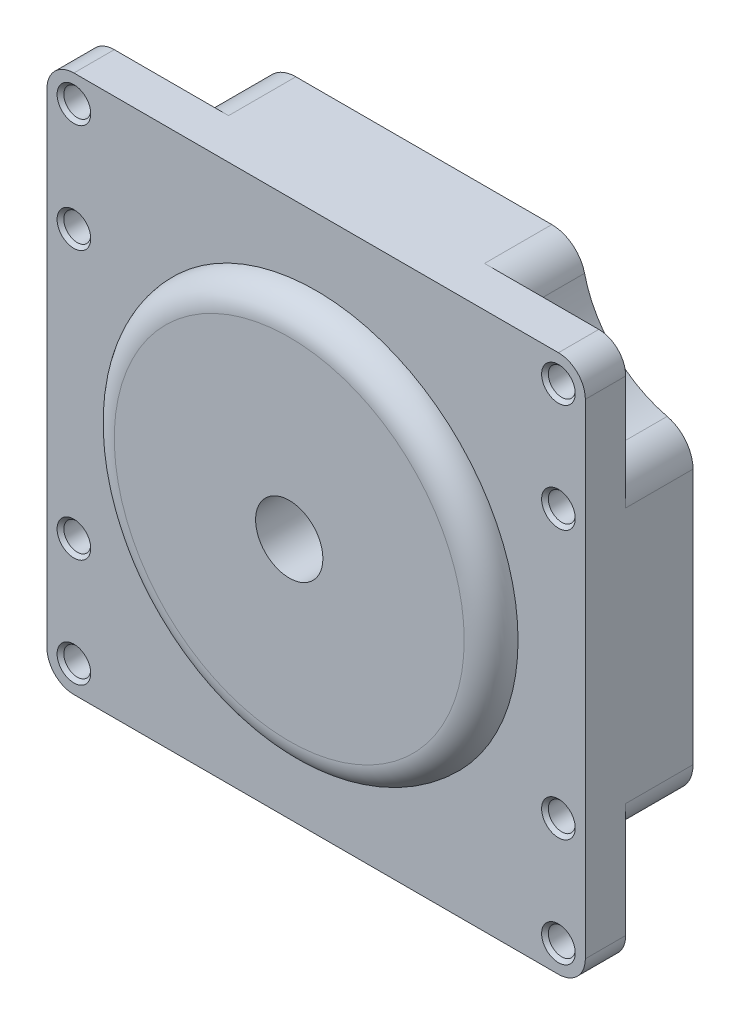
ISO-10303-21;
HEADER;
FILE_DESCRIPTION(('STEP AP214'),'2;1');
FILE_NAME('part.step','',(''),(''),'','','');
FILE_SCHEMA(('AUTOMOTIVE_DESIGN { 1 0 10303 214 1 1 1 1 }'));
ENDSEC;
DATA;
#1=APPLICATION_CONTEXT('core data for automotive mechanical design processes');
#2=APPLICATION_PROTOCOL_DEFINITION('international standard','automotive_design',2000,#1);
#3=PRODUCT_CONTEXT('',#1,'mechanical');
#4=PRODUCT('Part','Part','',(#3));
#5=PRODUCT_RELATED_PRODUCT_CATEGORY('part','',(#4));
#6=PRODUCT_DEFINITION_FORMATION('','',#4);
#7=PRODUCT_DEFINITION_CONTEXT('part definition',#1,'design');
#8=PRODUCT_DEFINITION('design','',#6,#7);
#9=PRODUCT_DEFINITION_SHAPE('','',#8);
#10=(LENGTH_UNIT() NAMED_UNIT(*) SI_UNIT(.MILLI.,.METRE.));
#11=(NAMED_UNIT(*) PLANE_ANGLE_UNIT() SI_UNIT($,.RADIAN.));
#12=(NAMED_UNIT(*) SI_UNIT($,.STERADIAN.) SOLID_ANGLE_UNIT());
#13=UNCERTAINTY_MEASURE_WITH_UNIT(LENGTH_MEASURE(1.E-05),#10,'distance_accuracy_value','');
#14=(GEOMETRIC_REPRESENTATION_CONTEXT(3) GLOBAL_UNCERTAINTY_ASSIGNED_CONTEXT((#13)) GLOBAL_UNIT_ASSIGNED_CONTEXT((#10,
#11,#12)) REPRESENTATION_CONTEXT('',''));
#15=CARTESIAN_POINT('',(0.,0.,0.));
#16=DIRECTION('',(0.,0.,1.));
#17=DIRECTION('',(1.,0.,0.));
#18=AXIS2_PLACEMENT_3D('',#15,#16,#17);
#19=CARTESIAN_POINT('',(-17.5,9.50950399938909,0.));
#20=DIRECTION('',(0.,0.,1.));
#21=DIRECTION('',(1.,0.,0.));
#22=AXIS2_PLACEMENT_3D('',#19,#20,#21);
#23=PLANE('',#22);
#24=CARTESIAN_POINT('',(-9.96077428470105,18.,0.));
#25=DIRECTION('',(0.,0.,1.));
#26=DIRECTION('',(1.,0.,0.));
#27=AXIS2_PLACEMENT_3D('',#24,#25,#26);
#28=CIRCLE('',#27,1.);
#29=CARTESIAN_POINT('',(-8.96077428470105,18.,0.));
#30=VERTEX_POINT('',#29);
#31=EDGE_CURVE('E383',#30,#30,#28,.T.);
#32=ORIENTED_EDGE('',*,*,#31,.T.);
#33=EDGE_LOOP('',(#32));
#34=FACE_BOUND('',#33,.T.);
#35=CARTESIAN_POINT('',(9.96077428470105,18.,0.));
#36=DIRECTION('',(0.,0.,1.));
#37=DIRECTION('',(1.,0.,0.));
#38=AXIS2_PLACEMENT_3D('',#35,#36,#37);
#39=CIRCLE('',#38,1.);
#40=CARTESIAN_POINT('',(10.9607742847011,18.,0.));
#41=VERTEX_POINT('',#40);
#42=EDGE_CURVE('E386',#41,#41,#39,.T.);
#43=ORIENTED_EDGE('',*,*,#42,.T.);
#44=EDGE_LOOP('',(#43));
#45=FACE_BOUND('',#44,.T.);
#46=CARTESIAN_POINT('',(18.,9.96077428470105,0.));
#47=DIRECTION('',(0.,0.,1.));
#48=DIRECTION('',(1.,0.,0.));
#49=AXIS2_PLACEMENT_3D('',#46,#47,#48);
#50=CIRCLE('',#49,1.);
#51=CARTESIAN_POINT('',(19.,9.96077428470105,0.));
#52=VERTEX_POINT('',#51);
#53=EDGE_CURVE('E393',#52,#52,#50,.T.);
#54=ORIENTED_EDGE('',*,*,#53,.T.);
#55=EDGE_LOOP('',(#54));
#56=FACE_BOUND('',#55,.T.);
#57=CARTESIAN_POINT('',(18.,-9.96077428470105,0.));
#58=DIRECTION('',(0.,0.,1.));
#59=DIRECTION('',(1.,0.,0.));
#60=AXIS2_PLACEMENT_3D('',#57,#58,#59);
#61=CIRCLE('',#60,1.);
#62=CARTESIAN_POINT('',(19.,-9.96077428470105,0.));
#63=VERTEX_POINT('',#62);
#64=EDGE_CURVE('E399',#63,#63,#61,.T.);
#65=ORIENTED_EDGE('',*,*,#64,.T.);
#66=EDGE_LOOP('',(#65));
#67=FACE_BOUND('',#66,.T.);
#68=CARTESIAN_POINT('',(9.96077428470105,-18.,0.));
#69=DIRECTION('',(0.,0.,1.));
#70=DIRECTION('',(1.,0.,0.));
#71=AXIS2_PLACEMENT_3D('',#68,#69,#70);
#72=CIRCLE('',#71,1.);
#73=CARTESIAN_POINT('',(10.9607742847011,-18.,0.));
#74=VERTEX_POINT('',#73);
#75=EDGE_CURVE('E402',#74,#74,#72,.T.);
#76=ORIENTED_EDGE('',*,*,#75,.T.);
#77=EDGE_LOOP('',(#76));
#78=FACE_BOUND('',#77,.T.);
#79=CARTESIAN_POINT('',(-9.96077428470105,-18.,0.));
#80=DIRECTION('',(0.,0.,1.));
#81=DIRECTION('',(1.,0.,0.));
#82=AXIS2_PLACEMENT_3D('',#79,#80,#81);
#83=CIRCLE('',#82,1.);
#84=CARTESIAN_POINT('',(-8.96077428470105,-18.,0.));
#85=VERTEX_POINT('',#84);
#86=EDGE_CURVE('E405',#85,#85,#83,.T.);
#87=ORIENTED_EDGE('',*,*,#86,.T.);
#88=EDGE_LOOP('',(#87));
#89=FACE_BOUND('',#88,.T.);
#90=CARTESIAN_POINT('',(-18.,-9.96077428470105,0.));
#91=DIRECTION('',(0.,0.,1.));
#92=DIRECTION('',(1.,0.,0.));
#93=AXIS2_PLACEMENT_3D('',#90,#91,#92);
#94=CIRCLE('',#93,1.);
#95=CARTESIAN_POINT('',(-17.,-9.96077428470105,0.));
#96=VERTEX_POINT('',#95);
#97=EDGE_CURVE('E411',#96,#96,#94,.T.);
#98=ORIENTED_EDGE('',*,*,#97,.T.);
#99=EDGE_LOOP('',(#98));
#100=FACE_BOUND('',#99,.T.);
#101=CARTESIAN_POINT('',(-18.,9.96077428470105,0.));
#102=DIRECTION('',(0.,0.,1.));
#103=DIRECTION('',(1.,0.,0.));
#104=AXIS2_PLACEMENT_3D('',#101,#102,#103);
#105=CIRCLE('',#104,1.);
#106=CARTESIAN_POINT('',(-17.,9.96077428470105,0.));
#107=VERTEX_POINT('',#106);
#108=EDGE_CURVE('E417',#107,#107,#105,.T.);
#109=ORIENTED_EDGE('',*,*,#108,.T.);
#110=EDGE_LOOP('',(#109));
#111=FACE_BOUND('',#110,.T.);
#112=CARTESIAN_POINT('',(-17.5,9.50950399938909,0.));
#113=DIRECTION('',(0.,0.,1.));
#114=DIRECTION('',(1.,0.,0.));
#115=AXIS2_PLACEMENT_3D('',#112,#113,#114);
#116=CIRCLE('',#115,2.5);
#117=CARTESIAN_POINT('',(-18.0795477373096,11.9414012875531,0.));
#118=VERTEX_POINT('',#117);
#119=CARTESIAN_POINT('',(-20.,9.50950399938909,0.));
#120=VERTEX_POINT('',#119);
#121=EDGE_CURVE('E231',#118,#120,#116,.T.);
#122=ORIENTED_EDGE('',*,*,#121,.F.);
#123=CARTESIAN_POINT('',(-20.,20.,0.));
#124=DIRECTION('',(0.,0.,-1.));
#125=DIRECTION('',(-1.,0.,0.));
#126=AXIS2_PLACEMENT_3D('',#123,#124,#125);
#127=CIRCLE('',#126,8.2842712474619);
#128=CARTESIAN_POINT('',(-11.9414012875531,18.0795477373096,0.));
#129=VERTEX_POINT('',#128);
#130=EDGE_CURVE('E209',#129,#118,#127,.T.);
#131=ORIENTED_EDGE('',*,*,#130,.F.);
#132=CARTESIAN_POINT('',(-9.50950399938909,17.5,0.));
#133=DIRECTION('',(0.,0.,1.));
#134=DIRECTION('',(1.,0.,0.));
#135=AXIS2_PLACEMENT_3D('',#132,#133,#134);
#136=CIRCLE('',#135,2.5);
#137=CARTESIAN_POINT('',(-9.50950399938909,20.,0.));
#138=VERTEX_POINT('',#137);
#139=EDGE_CURVE('E260',#138,#129,#136,.T.);
#140=ORIENTED_EDGE('',*,*,#139,.F.);
#141=DIRECTION('',(-1.,0.,0.));
#142=VECTOR('',#141,1.);
#143=CARTESIAN_POINT('',(9.50950399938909,20.,0.));
#144=LINE('',#143,#142);
#145=CARTESIAN_POINT('',(9.50950399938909,20.,0.));
#146=VERTEX_POINT('',#145);
#147=EDGE_CURVE('E258',#146,#138,#144,.T.);
#148=ORIENTED_EDGE('',*,*,#147,.F.);
#149=CARTESIAN_POINT('',(9.50950399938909,17.5,0.));
#150=DIRECTION('',(0.,0.,1.));
#151=DIRECTION('',(1.,0.,0.));
#152=AXIS2_PLACEMENT_3D('',#149,#150,#151);
#153=CIRCLE('',#152,2.5);
#154=CARTESIAN_POINT('',(11.9414012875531,18.0795477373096,0.));
#155=VERTEX_POINT('',#154);
#156=EDGE_CURVE('E256',#155,#146,#153,.T.);
#157=ORIENTED_EDGE('',*,*,#156,.F.);
#158=CARTESIAN_POINT('',(20.,20.,0.));
#159=DIRECTION('',(0.,0.,-1.));
#160=DIRECTION('',(-1.,0.,0.));
#161=AXIS2_PLACEMENT_3D('',#158,#159,#160);
#162=CIRCLE('',#161,8.2842712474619);
#163=CARTESIAN_POINT('',(18.0795477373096,11.9414012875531,0.));
#164=VERTEX_POINT('',#163);
#165=EDGE_CURVE('E254',#164,#155,#162,.T.);
#166=ORIENTED_EDGE('',*,*,#165,.F.);
#167=CARTESIAN_POINT('',(17.5,9.50950399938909,0.));
#168=DIRECTION('',(0.,0.,1.));
#169=DIRECTION('',(1.,0.,0.));
#170=AXIS2_PLACEMENT_3D('',#167,#168,#169);
#171=CIRCLE('',#170,2.5);
#172=CARTESIAN_POINT('',(20.,9.50950399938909,0.));
#173=VERTEX_POINT('',#172);
#174=EDGE_CURVE('E252',#173,#164,#171,.T.);
#175=ORIENTED_EDGE('',*,*,#174,.F.);
#176=DIRECTION('',(0.,1.,0.));
#177=VECTOR('',#176,1.);
#178=CARTESIAN_POINT('',(20.,-9.50950399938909,0.));
#179=LINE('',#178,#177);
#180=CARTESIAN_POINT('',(20.,-9.50950399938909,0.));
#181=VERTEX_POINT('',#180);
#182=EDGE_CURVE('E250',#181,#173,#179,.T.);
#183=ORIENTED_EDGE('',*,*,#182,.F.);
#184=CARTESIAN_POINT('',(17.5,-9.50950399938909,0.));
#185=DIRECTION('',(0.,0.,1.));
#186=DIRECTION('',(1.,0.,0.));
#187=AXIS2_PLACEMENT_3D('',#184,#185,#186);
#188=CIRCLE('',#187,2.5);
#189=CARTESIAN_POINT('',(18.0795477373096,-11.9414012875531,0.));
#190=VERTEX_POINT('',#189);
#191=EDGE_CURVE('E248',#190,#181,#188,.T.);
#192=ORIENTED_EDGE('',*,*,#191,.F.);
#193=CARTESIAN_POINT('',(20.,-20.,0.));
#194=DIRECTION('',(0.,0.,-1.));
#195=DIRECTION('',(-1.,0.,0.));
#196=AXIS2_PLACEMENT_3D('',#193,#194,#195);
#197=CIRCLE('',#196,8.2842712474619);
#198=CARTESIAN_POINT('',(11.9414012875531,-18.0795477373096,0.));
#199=VERTEX_POINT('',#198);
#200=EDGE_CURVE('E246',#199,#190,#197,.T.);
#201=ORIENTED_EDGE('',*,*,#200,.F.);
#202=CARTESIAN_POINT('',(9.50950399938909,-17.5,0.));
#203=DIRECTION('',(0.,0.,1.));
#204=DIRECTION('',(1.,0.,0.));
#205=AXIS2_PLACEMENT_3D('',#202,#203,#204);
#206=CIRCLE('',#205,2.5);
#207=CARTESIAN_POINT('',(9.50950399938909,-20.,0.));
#208=VERTEX_POINT('',#207);
#209=EDGE_CURVE('E244',#208,#199,#206,.T.);
#210=ORIENTED_EDGE('',*,*,#209,.F.);
#211=DIRECTION('',(1.,0.,0.));
#212=VECTOR('',#211,1.);
#213=CARTESIAN_POINT('',(-9.50950399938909,-20.,0.));
#214=LINE('',#213,#212);
#215=CARTESIAN_POINT('',(-9.50950399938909,-20.,0.));
#216=VERTEX_POINT('',#215);
#217=EDGE_CURVE('E242',#216,#208,#214,.T.);
#218=ORIENTED_EDGE('',*,*,#217,.F.);
#219=CARTESIAN_POINT('',(-9.50950399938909,-17.5,0.));
#220=DIRECTION('',(0.,0.,1.));
#221=DIRECTION('',(1.,0.,0.));
#222=AXIS2_PLACEMENT_3D('',#219,#220,#221);
#223=CIRCLE('',#222,2.5);
#224=CARTESIAN_POINT('',(-11.9414012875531,-18.0795477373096,0.));
#225=VERTEX_POINT('',#224);
#226=EDGE_CURVE('E240',#225,#216,#223,.T.);
#227=ORIENTED_EDGE('',*,*,#226,.F.);
#228=CARTESIAN_POINT('',(-20.,-20.,0.));
#229=DIRECTION('',(0.,0.,-1.));
#230=DIRECTION('',(-1.,0.,0.));
#231=AXIS2_PLACEMENT_3D('',#228,#229,#230);
#232=CIRCLE('',#231,8.2842712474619);
#233=CARTESIAN_POINT('',(-18.0795477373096,-11.9414012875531,0.));
#234=VERTEX_POINT('',#233);
#235=EDGE_CURVE('E238',#234,#225,#232,.T.);
#236=ORIENTED_EDGE('',*,*,#235,.F.);
#237=CARTESIAN_POINT('',(-17.5,-9.50950399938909,0.));
#238=DIRECTION('',(0.,0.,1.));
#239=DIRECTION('',(1.,0.,0.));
#240=AXIS2_PLACEMENT_3D('',#237,#238,#239);
#241=CIRCLE('',#240,2.5);
#242=CARTESIAN_POINT('',(-20.,-9.50950399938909,0.));
#243=VERTEX_POINT('',#242);
#244=EDGE_CURVE('E236',#243,#234,#241,.T.);
#245=ORIENTED_EDGE('',*,*,#244,.F.);
#246=DIRECTION('',(0.,-1.,0.));
#247=VECTOR('',#246,1.);
#248=CARTESIAN_POINT('',(-20.,9.50950399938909,0.));
#249=LINE('',#248,#247);
#250=EDGE_CURVE('E233',#120,#243,#249,.T.);
#251=ORIENTED_EDGE('',*,*,#250,.F.);
#252=EDGE_LOOP('',(#122,#131,#140,#148,#157,#166,#175,#183,#192,#201,#210,#218,#227,#236,#245,#251));
#253=FACE_BOUND('',#252,.T.);
#254=CARTESIAN_POINT('',(0.,0.,0.));
#255=DIRECTION('',(0.,0.,1.));
#256=DIRECTION('',(1.,0.,0.));
#257=AXIS2_PLACEMENT_3D('',#254,#255,#256);
#258=CIRCLE('',#257,7.5);
#259=CARTESIAN_POINT('',(7.5,0.,0.));
#260=VERTEX_POINT('',#259);
#261=EDGE_CURVE('E234',#260,#260,#258,.T.);
#262=ORIENTED_EDGE('',*,*,#261,.T.);
#263=EDGE_LOOP('',(#262));
#264=FACE_BOUND('',#263,.T.);
#265=ADVANCED_FACE('F33',(#34,#45,#56,#67,#78,#89,#100,#111,#253,#264),#23,.F.);
#266=CARTESIAN_POINT('',(-17.5,9.50950399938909,5.));
#267=DIRECTION('',(0.,0.,-1.));
#268=DIRECTION('',(-1.,0.,0.));
#269=AXIS2_PLACEMENT_3D('',#266,#267,#268);
#270=CYLINDRICAL_SURFACE('',#269,2.5);
#271=ORIENTED_EDGE('',*,*,#121,.T.);
#272=DIRECTION('',(0.,0.,-1.));
#273=VECTOR('',#272,1.);
#274=CARTESIAN_POINT('',(-20.,9.50950399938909,5.));
#275=LINE('',#274,#273);
#276=CARTESIAN_POINT('',(-20.,9.50950399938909,5.));
#277=VERTEX_POINT('',#276);
#278=EDGE_CURVE('E204',#277,#120,#275,.T.);
#279=ORIENTED_EDGE('',*,*,#278,.F.);
#280=CARTESIAN_POINT('',(-17.5,9.50950399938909,5.));
#281=DIRECTION('',(0.,0.,1.));
#282=DIRECTION('',(1.,0.,0.));
#283=AXIS2_PLACEMENT_3D('',#280,#281,#282);
#284=CIRCLE('',#283,2.5);
#285=CARTESIAN_POINT('',(-18.0795477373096,11.9414012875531,5.));
#286=VERTEX_POINT('',#285);
#287=EDGE_CURVE('E197',#286,#277,#284,.T.);
#288=ORIENTED_EDGE('',*,*,#287,.F.);
#289=DIRECTION('',(0.,0.,-1.));
#290=VECTOR('',#289,1.);
#291=CARTESIAN_POINT('',(-18.0795477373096,11.9414012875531,5.));
#292=LINE('',#291,#290);
#293=EDGE_CURVE('E201',#286,#118,#292,.T.);
#294=ORIENTED_EDGE('',*,*,#293,.T.);
#295=EDGE_LOOP('',(#271,#279,#288,#294));
#296=FACE_BOUND('',#295,.T.);
#297=ADVANCED_FACE('F200',(#296),#270,.T.);
#298=CARTESIAN_POINT('',(-20.,9.50950399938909,5.));
#299=DIRECTION('',(1.,0.,0.));
#300=DIRECTION('',(0.,0.,-1.));
#301=AXIS2_PLACEMENT_3D('',#298,#299,#300);
#302=PLANE('',#301);
#303=DIRECTION('',(0.,-1.,0.));
#304=VECTOR('',#303,1.);
#305=CARTESIAN_POINT('',(-20.,20.,5.));
#306=LINE('',#305,#304);
#307=CARTESIAN_POINT('',(-20.,-9.50950399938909,5.));
#308=VERTEX_POINT('',#307);
#309=CARTESIAN_POINT('',(-20.,-18.,5.));
#310=VERTEX_POINT('',#309);
#311=EDGE_CURVE('E445',#308,#310,#306,.T.);
#312=ORIENTED_EDGE('',*,*,#311,.T.);
#313=DIRECTION('',(0.,0.,-1.));
#314=VECTOR('',#313,1.);
#315=CARTESIAN_POINT('',(-20.,-18.,5.));
#316=LINE('',#315,#314);
#317=CARTESIAN_POINT('',(-20.,-18.,8.));
#318=VERTEX_POINT('',#317);
#319=EDGE_CURVE('E801',#310,#318,#316,.F.);
#320=ORIENTED_EDGE('',*,*,#319,.T.);
#321=DIRECTION('',(0.,-1.,0.));
#322=VECTOR('',#321,1.);
#323=CARTESIAN_POINT('',(-20.,20.,8.));
#324=LINE('',#323,#322);
#325=CARTESIAN_POINT('',(-20.,18.,8.));
#326=VERTEX_POINT('',#325);
#327=EDGE_CURVE('E466',#326,#318,#324,.T.);
#328=ORIENTED_EDGE('',*,*,#327,.F.);
#329=DIRECTION('',(0.,0.,-1.));
#330=VECTOR('',#329,1.);
#331=CARTESIAN_POINT('',(-20.,18.,5.));
#332=LINE('',#331,#330);
#333=CARTESIAN_POINT('',(-20.,18.,5.));
#334=VERTEX_POINT('',#333);
#335=EDGE_CURVE('E443',#326,#334,#332,.T.);
#336=ORIENTED_EDGE('',*,*,#335,.T.);
#337=EDGE_CURVE('E382',#334,#277,#306,.T.);
#338=ORIENTED_EDGE('',*,*,#337,.T.);
#339=ORIENTED_EDGE('',*,*,#278,.T.);
#340=ORIENTED_EDGE('',*,*,#250,.T.);
#341=DIRECTION('',(0.,0.,-1.));
#342=VECTOR('',#341,1.);
#343=CARTESIAN_POINT('',(-20.,-9.50950399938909,5.));
#344=LINE('',#343,#342);
#345=EDGE_CURVE('E288',#308,#243,#344,.T.);
#346=ORIENTED_EDGE('',*,*,#345,.F.);
#347=EDGE_LOOP('',(#312,#320,#328,#336,#338,#339,#340,#346));
#348=FACE_BOUND('',#347,.T.);
#349=ADVANCED_FACE('F582',(#348),#302,.F.);
#350=CARTESIAN_POINT('',(-17.5,-9.50950399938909,5.));
#351=DIRECTION('',(0.,0.,-1.));
#352=DIRECTION('',(-1.,0.,0.));
#353=AXIS2_PLACEMENT_3D('',#350,#351,#352);
#354=CYLINDRICAL_SURFACE('',#353,2.5);
#355=ORIENTED_EDGE('',*,*,#244,.T.);
#356=DIRECTION('',(0.,0.,-1.));
#357=VECTOR('',#356,1.);
#358=CARTESIAN_POINT('',(-18.0795477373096,-11.9414012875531,5.));
#359=LINE('',#358,#357);
#360=CARTESIAN_POINT('',(-18.0795477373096,-11.9414012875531,5.));
#361=VERTEX_POINT('',#360);
#362=EDGE_CURVE('E284',#361,#234,#359,.T.);
#363=ORIENTED_EDGE('',*,*,#362,.F.);
#364=CARTESIAN_POINT('',(-17.5,-9.50950399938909,5.));
#365=DIRECTION('',(0.,0.,1.));
#366=DIRECTION('',(1.,0.,0.));
#367=AXIS2_PLACEMENT_3D('',#364,#365,#366);
#368=CIRCLE('',#367,2.5);
#369=EDGE_CURVE('E208',#308,#361,#368,.T.);
#370=ORIENTED_EDGE('',*,*,#369,.F.);
#371=ORIENTED_EDGE('',*,*,#345,.T.);
#372=EDGE_LOOP('',(#355,#363,#370,#371));
#373=FACE_BOUND('',#372,.T.);
#374=ADVANCED_FACE('F630',(#373),#354,.T.);
#375=CARTESIAN_POINT('',(-20.,-20.,5.));
#376=DIRECTION('',(0.,0.,-1.));
#377=DIRECTION('',(-1.,0.,0.));
#378=AXIS2_PLACEMENT_3D('',#375,#376,#377);
#379=CYLINDRICAL_SURFACE('',#378,8.2842712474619);
#380=ORIENTED_EDGE('',*,*,#235,.T.);
#381=DIRECTION('',(0.,0.,-1.));
#382=VECTOR('',#381,1.);
#383=CARTESIAN_POINT('',(-11.9414012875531,-18.0795477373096,5.));
#384=LINE('',#383,#382);
#385=CARTESIAN_POINT('',(-11.9414012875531,-18.0795477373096,5.));
#386=VERTEX_POINT('',#385);
#387=EDGE_CURVE('E281',#386,#225,#384,.T.);
#388=ORIENTED_EDGE('',*,*,#387,.F.);
#389=CARTESIAN_POINT('',(-20.,-20.,5.));
#390=DIRECTION('',(0.,0.,-1.));
#391=DIRECTION('',(-1.,0.,0.));
#392=AXIS2_PLACEMENT_3D('',#389,#390,#391);
#393=CIRCLE('',#392,8.2842712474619);
#394=EDGE_CURVE('E427',#361,#386,#393,.T.);
#395=ORIENTED_EDGE('',*,*,#394,.F.);
#396=ORIENTED_EDGE('',*,*,#362,.T.);
#397=EDGE_LOOP('',(#380,#388,#395,#396));
#398=FACE_BOUND('',#397,.T.);
#399=ADVANCED_FACE('F626',(#398),#379,.F.);
#400=CARTESIAN_POINT('',(-9.50950399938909,-17.5,5.));
#401=DIRECTION('',(0.,0.,-1.));
#402=DIRECTION('',(-1.,0.,0.));
#403=AXIS2_PLACEMENT_3D('',#400,#401,#402);
#404=CYLINDRICAL_SURFACE('',#403,2.5);
#405=ORIENTED_EDGE('',*,*,#226,.T.);
#406=DIRECTION('',(0.,0.,-1.));
#407=VECTOR('',#406,1.);
#408=CARTESIAN_POINT('',(-9.50950399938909,-20.,5.));
#409=LINE('',#408,#407);
#410=CARTESIAN_POINT('',(-9.50950399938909,-20.,5.));
#411=VERTEX_POINT('',#410);
#412=EDGE_CURVE('E285',#411,#216,#409,.T.);
#413=ORIENTED_EDGE('',*,*,#412,.F.);
#414=CARTESIAN_POINT('',(-9.50950399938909,-17.5,5.));
#415=DIRECTION('',(0.,0.,1.));
#416=DIRECTION('',(1.,0.,0.));
#417=AXIS2_PLACEMENT_3D('',#414,#415,#416);
#418=CIRCLE('',#417,2.5);
#419=EDGE_CURVE('E815',#386,#411,#418,.T.);
#420=ORIENTED_EDGE('',*,*,#419,.F.);
#421=ORIENTED_EDGE('',*,*,#387,.T.);
#422=EDGE_LOOP('',(#405,#413,#420,#421));
#423=FACE_BOUND('',#422,.T.);
#424=ADVANCED_FACE('F622',(#423),#404,.T.);
#425=CARTESIAN_POINT('',(-9.50950399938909,-20.,5.));
#426=DIRECTION('',(0.,1.,0.));
#427=DIRECTION('',(0.,0.,1.));
#428=AXIS2_PLACEMENT_3D('',#425,#426,#427);
#429=PLANE('',#428);
#430=DIRECTION('',(1.,0.,0.));
#431=VECTOR('',#430,1.);
#432=CARTESIAN_POINT('',(-20.,-20.,8.));
#433=LINE('',#432,#431);
#434=CARTESIAN_POINT('',(-18.,-20.,8.));
#435=VERTEX_POINT('',#434);
#436=CARTESIAN_POINT('',(18.,-20.,8.));
#437=VERTEX_POINT('',#436);
#438=EDGE_CURVE('E469',#435,#437,#433,.T.);
#439=ORIENTED_EDGE('',*,*,#438,.F.);
#440=DIRECTION('',(0.,0.,-1.));
#441=VECTOR('',#440,1.);
#442=CARTESIAN_POINT('',(-18.,-20.,5.));
#443=LINE('',#442,#441);
#444=CARTESIAN_POINT('',(-18.,-20.,5.));
#445=VERTEX_POINT('',#444);
#446=EDGE_CURVE('E438',#435,#445,#443,.T.);
#447=ORIENTED_EDGE('',*,*,#446,.T.);
#448=DIRECTION('',(1.,0.,0.));
#449=VECTOR('',#448,1.);
#450=CARTESIAN_POINT('',(-20.,-20.,5.));
#451=LINE('',#450,#449);
#452=EDGE_CURVE('E378',#445,#411,#451,.T.);
#453=ORIENTED_EDGE('',*,*,#452,.T.);
#454=ORIENTED_EDGE('',*,*,#412,.T.);
#455=ORIENTED_EDGE('',*,*,#217,.T.);
#456=DIRECTION('',(0.,0.,-1.));
#457=VECTOR('',#456,1.);
#458=CARTESIAN_POINT('',(9.50950399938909,-20.,5.));
#459=LINE('',#458,#457);
#460=CARTESIAN_POINT('',(9.50950399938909,-20.,5.));
#461=VERTEX_POINT('',#460);
#462=EDGE_CURVE('E280',#461,#208,#459,.T.);
#463=ORIENTED_EDGE('',*,*,#462,.F.);
#464=CARTESIAN_POINT('',(18.,-20.,5.));
#465=VERTEX_POINT('',#464);
#466=EDGE_CURVE('E379',#461,#465,#451,.T.);
#467=ORIENTED_EDGE('',*,*,#466,.T.);
#468=DIRECTION('',(0.,0.,-1.));
#469=VECTOR('',#468,1.);
#470=CARTESIAN_POINT('',(18.,-20.,5.));
#471=LINE('',#470,#469);
#472=EDGE_CURVE('E433',#465,#437,#471,.F.);
#473=ORIENTED_EDGE('',*,*,#472,.T.);
#474=EDGE_LOOP('',(#439,#447,#453,#454,#455,#463,#467,#473));
#475=FACE_BOUND('',#474,.T.);
#476=ADVANCED_FACE('F618',(#475),#429,.F.);
#477=CARTESIAN_POINT('',(9.50950399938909,-17.5,5.));
#478=DIRECTION('',(0.,0.,-1.));
#479=DIRECTION('',(-1.,0.,0.));
#480=AXIS2_PLACEMENT_3D('',#477,#478,#479);
#481=CYLINDRICAL_SURFACE('',#480,2.5);
#482=ORIENTED_EDGE('',*,*,#209,.T.);
#483=DIRECTION('',(0.,0.,-1.));
#484=VECTOR('',#483,1.);
#485=CARTESIAN_POINT('',(11.9414012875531,-18.0795477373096,5.));
#486=LINE('',#485,#484);
#487=CARTESIAN_POINT('',(11.9414012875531,-18.0795477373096,5.));
#488=VERTEX_POINT('',#487);
#489=EDGE_CURVE('E276',#488,#199,#486,.T.);
#490=ORIENTED_EDGE('',*,*,#489,.F.);
#491=CARTESIAN_POINT('',(9.50950399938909,-17.5,5.));
#492=DIRECTION('',(0.,0.,1.));
#493=DIRECTION('',(1.,0.,0.));
#494=AXIS2_PLACEMENT_3D('',#491,#492,#493);
#495=CIRCLE('',#494,2.5);
#496=EDGE_CURVE('E818',#461,#488,#495,.T.);
#497=ORIENTED_EDGE('',*,*,#496,.F.);
#498=ORIENTED_EDGE('',*,*,#462,.T.);
#499=EDGE_LOOP('',(#482,#490,#497,#498));
#500=FACE_BOUND('',#499,.T.);
#501=ADVANCED_FACE('F614',(#500),#481,.T.);
#502=CARTESIAN_POINT('',(20.,-20.,5.));
#503=DIRECTION('',(0.,0.,-1.));
#504=DIRECTION('',(-1.,0.,0.));
#505=AXIS2_PLACEMENT_3D('',#502,#503,#504);
#506=CYLINDRICAL_SURFACE('',#505,8.2842712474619);
#507=ORIENTED_EDGE('',*,*,#200,.T.);
#508=DIRECTION('',(0.,0.,-1.));
#509=VECTOR('',#508,1.);
#510=CARTESIAN_POINT('',(18.0795477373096,-11.9414012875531,5.));
#511=LINE('',#510,#509);
#512=CARTESIAN_POINT('',(18.0795477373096,-11.9414012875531,5.));
#513=VERTEX_POINT('',#512);
#514=EDGE_CURVE('E273',#513,#190,#511,.T.);
#515=ORIENTED_EDGE('',*,*,#514,.F.);
#516=CARTESIAN_POINT('',(20.,-20.,5.));
#517=DIRECTION('',(0.,0.,-1.));
#518=DIRECTION('',(-1.,0.,0.));
#519=AXIS2_PLACEMENT_3D('',#516,#517,#518);
#520=CIRCLE('',#519,8.2842712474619);
#521=EDGE_CURVE('E315',#488,#513,#520,.T.);
#522=ORIENTED_EDGE('',*,*,#521,.F.);
#523=ORIENTED_EDGE('',*,*,#489,.T.);
#524=EDGE_LOOP('',(#507,#515,#522,#523));
#525=FACE_BOUND('',#524,.T.);
#526=ADVANCED_FACE('F610',(#525),#506,.F.);
#527=CARTESIAN_POINT('',(17.5,-9.50950399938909,5.));
#528=DIRECTION('',(0.,0.,-1.));
#529=DIRECTION('',(-1.,0.,0.));
#530=AXIS2_PLACEMENT_3D('',#527,#528,#529);
#531=CYLINDRICAL_SURFACE('',#530,2.5);
#532=ORIENTED_EDGE('',*,*,#191,.T.);
#533=DIRECTION('',(0.,0.,-1.));
#534=VECTOR('',#533,1.);
#535=CARTESIAN_POINT('',(20.,-9.50950399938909,5.));
#536=LINE('',#535,#534);
#537=CARTESIAN_POINT('',(20.,-9.50950399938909,5.));
#538=VERTEX_POINT('',#537);
#539=EDGE_CURVE('E277',#538,#181,#536,.T.);
#540=ORIENTED_EDGE('',*,*,#539,.F.);
#541=CARTESIAN_POINT('',(17.5,-9.50950399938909,5.));
#542=DIRECTION('',(0.,0.,1.));
#543=DIRECTION('',(1.,0.,0.));
#544=AXIS2_PLACEMENT_3D('',#541,#542,#543);
#545=CIRCLE('',#544,2.5);
#546=EDGE_CURVE('E309',#513,#538,#545,.T.);
#547=ORIENTED_EDGE('',*,*,#546,.F.);
#548=ORIENTED_EDGE('',*,*,#514,.T.);
#549=EDGE_LOOP('',(#532,#540,#547,#548));
#550=FACE_BOUND('',#549,.T.);
#551=ADVANCED_FACE('F606',(#550),#531,.T.);
#552=CARTESIAN_POINT('',(20.,-9.50950399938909,5.));
#553=DIRECTION('',(-1.,0.,0.));
#554=DIRECTION('',(0.,0.,1.));
#555=AXIS2_PLACEMENT_3D('',#552,#553,#554);
#556=PLANE('',#555);
#557=DIRECTION('',(0.,1.,0.));
#558=VECTOR('',#557,1.);
#559=CARTESIAN_POINT('',(20.,20.,8.));
#560=LINE('',#559,#558);
#561=CARTESIAN_POINT('',(20.,-18.,8.));
#562=VERTEX_POINT('',#561);
#563=CARTESIAN_POINT('',(20.,18.,8.));
#564=VERTEX_POINT('',#563);
#565=EDGE_CURVE('E471',#562,#564,#560,.T.);
#566=ORIENTED_EDGE('',*,*,#565,.F.);
#567=DIRECTION('',(0.,0.,-1.));
#568=VECTOR('',#567,1.);
#569=CARTESIAN_POINT('',(20.,-18.,5.));
#570=LINE('',#569,#568);
#571=CARTESIAN_POINT('',(20.,-18.,5.));
#572=VERTEX_POINT('',#571);
#573=EDGE_CURVE('E360',#562,#572,#570,.T.);
#574=ORIENTED_EDGE('',*,*,#573,.T.);
#575=DIRECTION('',(0.,1.,0.));
#576=VECTOR('',#575,1.);
#577=CARTESIAN_POINT('',(20.,20.,5.));
#578=LINE('',#577,#576);
#579=EDGE_CURVE('E348',#572,#538,#578,.T.);
#580=ORIENTED_EDGE('',*,*,#579,.T.);
#581=ORIENTED_EDGE('',*,*,#539,.T.);
#582=ORIENTED_EDGE('',*,*,#182,.T.);
#583=DIRECTION('',(0.,0.,-1.));
#584=VECTOR('',#583,1.);
#585=CARTESIAN_POINT('',(20.,9.50950399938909,5.));
#586=LINE('',#585,#584);
#587=CARTESIAN_POINT('',(20.,9.50950399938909,5.));
#588=VERTEX_POINT('',#587);
#589=EDGE_CURVE('E272',#588,#173,#586,.T.);
#590=ORIENTED_EDGE('',*,*,#589,.F.);
#591=CARTESIAN_POINT('',(20.,18.,5.));
#592=VERTEX_POINT('',#591);
#593=EDGE_CURVE('E366',#588,#592,#578,.T.);
#594=ORIENTED_EDGE('',*,*,#593,.T.);
#595=DIRECTION('',(0.,0.,-1.));
#596=VECTOR('',#595,1.);
#597=CARTESIAN_POINT('',(20.,18.,5.));
#598=LINE('',#597,#596);
#599=EDGE_CURVE('E357',#592,#564,#598,.F.);
#600=ORIENTED_EDGE('',*,*,#599,.T.);
#601=EDGE_LOOP('',(#566,#574,#580,#581,#582,#590,#594,#600));
#602=FACE_BOUND('',#601,.T.);
#603=ADVANCED_FACE('F602',(#602),#556,.F.);
#604=CARTESIAN_POINT('',(17.5,9.50950399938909,5.));
#605=DIRECTION('',(0.,0.,-1.));
#606=DIRECTION('',(-1.,0.,0.));
#607=AXIS2_PLACEMENT_3D('',#604,#605,#606);
#608=CYLINDRICAL_SURFACE('',#607,2.5);
#609=ORIENTED_EDGE('',*,*,#174,.T.);
#610=DIRECTION('',(0.,0.,-1.));
#611=VECTOR('',#610,1.);
#612=CARTESIAN_POINT('',(18.0795477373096,11.9414012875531,5.));
#613=LINE('',#612,#611);
#614=CARTESIAN_POINT('',(18.0795477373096,11.9414012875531,5.));
#615=VERTEX_POINT('',#614);
#616=EDGE_CURVE('E268',#615,#164,#613,.T.);
#617=ORIENTED_EDGE('',*,*,#616,.F.);
#618=CARTESIAN_POINT('',(17.5,9.50950399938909,5.));
#619=DIRECTION('',(0.,0.,1.));
#620=DIRECTION('',(1.,0.,0.));
#621=AXIS2_PLACEMENT_3D('',#618,#619,#620);
#622=CIRCLE('',#621,2.5);
#623=EDGE_CURVE('E306',#588,#615,#622,.T.);
#624=ORIENTED_EDGE('',*,*,#623,.F.);
#625=ORIENTED_EDGE('',*,*,#589,.T.);
#626=EDGE_LOOP('',(#609,#617,#624,#625));
#627=FACE_BOUND('',#626,.T.);
#628=ADVANCED_FACE('F599',(#627),#608,.T.);
#629=CARTESIAN_POINT('',(20.,20.,5.));
#630=DIRECTION('',(0.,0.,-1.));
#631=DIRECTION('',(-1.,0.,0.));
#632=AXIS2_PLACEMENT_3D('',#629,#630,#631);
#633=CYLINDRICAL_SURFACE('',#632,8.2842712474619);
#634=ORIENTED_EDGE('',*,*,#165,.T.);
#635=DIRECTION('',(0.,0.,-1.));
#636=VECTOR('',#635,1.);
#637=CARTESIAN_POINT('',(11.9414012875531,18.0795477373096,5.));
#638=LINE('',#637,#636);
#639=CARTESIAN_POINT('',(11.9414012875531,18.0795477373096,5.));
#640=VERTEX_POINT('',#639);
#641=EDGE_CURVE('E265',#640,#155,#638,.T.);
#642=ORIENTED_EDGE('',*,*,#641,.F.);
#643=CARTESIAN_POINT('',(20.,20.,5.));
#644=DIRECTION('',(0.,0.,-1.));
#645=DIRECTION('',(-1.,0.,0.));
#646=AXIS2_PLACEMENT_3D('',#643,#644,#645);
#647=CIRCLE('',#646,8.2842712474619);
#648=EDGE_CURVE('E297',#615,#640,#647,.T.);
#649=ORIENTED_EDGE('',*,*,#648,.F.);
#650=ORIENTED_EDGE('',*,*,#616,.T.);
#651=EDGE_LOOP('',(#634,#642,#649,#650));
#652=FACE_BOUND('',#651,.T.);
#653=ADVANCED_FACE('F326',(#652),#633,.F.);
#654=CARTESIAN_POINT('',(9.50950399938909,17.5,5.));
#655=DIRECTION('',(0.,0.,-1.));
#656=DIRECTION('',(-1.,0.,0.));
#657=AXIS2_PLACEMENT_3D('',#654,#655,#656);
#658=CYLINDRICAL_SURFACE('',#657,2.5);
#659=ORIENTED_EDGE('',*,*,#156,.T.);
#660=DIRECTION('',(0.,0.,-1.));
#661=VECTOR('',#660,1.);
#662=CARTESIAN_POINT('',(9.50950399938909,20.,5.));
#663=LINE('',#662,#661);
#664=CARTESIAN_POINT('',(9.50950399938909,20.,5.));
#665=VERTEX_POINT('',#664);
#666=EDGE_CURVE('E269',#665,#146,#663,.T.);
#667=ORIENTED_EDGE('',*,*,#666,.F.);
#668=CARTESIAN_POINT('',(9.50950399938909,17.5,5.));
#669=DIRECTION('',(0.,0.,1.));
#670=DIRECTION('',(1.,0.,0.));
#671=AXIS2_PLACEMENT_3D('',#668,#669,#670);
#672=CIRCLE('',#671,2.5);
#673=EDGE_CURVE('E225',#640,#665,#672,.T.);
#674=ORIENTED_EDGE('',*,*,#673,.F.);
#675=ORIENTED_EDGE('',*,*,#641,.T.);
#676=EDGE_LOOP('',(#659,#667,#674,#675));
#677=FACE_BOUND('',#676,.T.);
#678=ADVANCED_FACE('F331',(#677),#658,.T.);
#679=CARTESIAN_POINT('',(9.50950399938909,20.,5.));
#680=DIRECTION('',(0.,-1.,0.));
#681=DIRECTION('',(0.,0.,-1.));
#682=AXIS2_PLACEMENT_3D('',#679,#680,#681);
#683=PLANE('',#682);
#684=DIRECTION('',(-1.,0.,0.));
#685=VECTOR('',#684,1.);
#686=CARTESIAN_POINT('',(-20.,20.,5.));
#687=LINE('',#686,#685);
#688=CARTESIAN_POINT('',(-9.50950399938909,20.,5.));
#689=VERTEX_POINT('',#688);
#690=CARTESIAN_POINT('',(-18.,20.,5.));
#691=VERTEX_POINT('',#690);
#692=EDGE_CURVE('E343',#689,#691,#687,.T.);
#693=ORIENTED_EDGE('',*,*,#692,.T.);
#694=DIRECTION('',(0.,0.,-1.));
#695=VECTOR('',#694,1.);
#696=CARTESIAN_POINT('',(-18.,20.,5.));
#697=LINE('',#696,#695);
#698=CARTESIAN_POINT('',(-18.,20.,8.));
#699=VERTEX_POINT('',#698);
#700=EDGE_CURVE('E346',#691,#699,#697,.F.);
#701=ORIENTED_EDGE('',*,*,#700,.T.);
#702=DIRECTION('',(-1.,0.,0.));
#703=VECTOR('',#702,1.);
#704=CARTESIAN_POINT('',(-20.,20.,8.));
#705=LINE('',#704,#703);
#706=CARTESIAN_POINT('',(18.,20.,8.));
#707=VERTEX_POINT('',#706);
#708=EDGE_CURVE('E422',#707,#699,#705,.T.);
#709=ORIENTED_EDGE('',*,*,#708,.F.);
#710=DIRECTION('',(0.,0.,-1.));
#711=VECTOR('',#710,1.);
#712=CARTESIAN_POINT('',(18.,20.,5.));
#713=LINE('',#712,#711);
#714=CARTESIAN_POINT('',(18.,20.,5.));
#715=VERTEX_POINT('',#714);
#716=EDGE_CURVE('E358',#707,#715,#713,.T.);
#717=ORIENTED_EDGE('',*,*,#716,.T.);
#718=EDGE_CURVE('E337',#715,#665,#687,.T.);
#719=ORIENTED_EDGE('',*,*,#718,.T.);
#720=ORIENTED_EDGE('',*,*,#666,.T.);
#721=ORIENTED_EDGE('',*,*,#147,.T.);
#722=DIRECTION('',(0.,0.,-1.));
#723=VECTOR('',#722,1.);
#724=CARTESIAN_POINT('',(-9.50950399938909,20.,5.));
#725=LINE('',#724,#723);
#726=EDGE_CURVE('E264',#689,#138,#725,.T.);
#727=ORIENTED_EDGE('',*,*,#726,.F.);
#728=EDGE_LOOP('',(#693,#701,#709,#717,#719,#720,#721,#727));
#729=FACE_BOUND('',#728,.T.);
#730=ADVANCED_FACE('F335',(#729),#683,.F.);
#731=CARTESIAN_POINT('',(-9.50950399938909,17.5,5.));
#732=DIRECTION('',(0.,0.,-1.));
#733=DIRECTION('',(-1.,0.,0.));
#734=AXIS2_PLACEMENT_3D('',#731,#732,#733);
#735=CYLINDRICAL_SURFACE('',#734,2.5);
#736=ORIENTED_EDGE('',*,*,#139,.T.);
#737=DIRECTION('',(0.,0.,-1.));
#738=VECTOR('',#737,1.);
#739=CARTESIAN_POINT('',(-11.9414012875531,18.0795477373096,5.));
#740=LINE('',#739,#738);
#741=CARTESIAN_POINT('',(-11.9414012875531,18.0795477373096,5.));
#742=VERTEX_POINT('',#741);
#743=EDGE_CURVE('E218',#742,#129,#740,.T.);
#744=ORIENTED_EDGE('',*,*,#743,.F.);
#745=CARTESIAN_POINT('',(-9.50950399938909,17.5,5.));
#746=DIRECTION('',(0.,0.,1.));
#747=DIRECTION('',(1.,0.,0.));
#748=AXIS2_PLACEMENT_3D('',#745,#746,#747);
#749=CIRCLE('',#748,2.5);
#750=EDGE_CURVE('E223',#689,#742,#749,.T.);
#751=ORIENTED_EDGE('',*,*,#750,.F.);
#752=ORIENTED_EDGE('',*,*,#726,.T.);
#753=EDGE_LOOP('',(#736,#744,#751,#752));
#754=FACE_BOUND('',#753,.T.);
#755=ADVANCED_FACE('F342',(#754),#735,.T.);
#756=CARTESIAN_POINT('',(-20.,20.,5.));
#757=DIRECTION('',(0.,0.,-1.));
#758=DIRECTION('',(-1.,0.,0.));
#759=AXIS2_PLACEMENT_3D('',#756,#757,#758);
#760=CYLINDRICAL_SURFACE('',#759,8.2842712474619);
#761=ORIENTED_EDGE('',*,*,#130,.T.);
#762=ORIENTED_EDGE('',*,*,#293,.F.);
#763=CARTESIAN_POINT('',(-20.,20.,5.));
#764=DIRECTION('',(0.,0.,-1.));
#765=DIRECTION('',(-1.,0.,0.));
#766=AXIS2_PLACEMENT_3D('',#763,#764,#765);
#767=CIRCLE('',#766,8.2842712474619);
#768=EDGE_CURVE('E215',#742,#286,#767,.T.);
#769=ORIENTED_EDGE('',*,*,#768,.F.);
#770=ORIENTED_EDGE('',*,*,#743,.T.);
#771=EDGE_LOOP('',(#761,#762,#769,#770));
#772=FACE_BOUND('',#771,.T.);
#773=ADVANCED_FACE('F213',(#772),#760,.F.);
#774=CARTESIAN_POINT('',(0.,0.,5.));
#775=DIRECTION('',(0.,0.,-1.));
#776=DIRECTION('',(-1.,0.,0.));
#777=AXIS2_PLACEMENT_3D('',#774,#775,#776);
#778=CYLINDRICAL_SURFACE('',#777,7.5);
#779=CARTESIAN_POINT('',(0.,0.,5.));
#780=DIRECTION('',(0.,0.,1.));
#781=DIRECTION('',(1.,0.,0.));
#782=AXIS2_PLACEMENT_3D('',#779,#780,#781);
#783=CIRCLE('',#782,7.5);
#784=CARTESIAN_POINT('',(7.5,0.,5.));
#785=VERTEX_POINT('',#784);
#786=EDGE_CURVE('E414',#785,#785,#783,.T.);
#787=ORIENTED_EDGE('',*,*,#786,.T.);
#788=EDGE_LOOP('',(#787));
#789=FACE_BOUND('',#788,.T.);
#790=ORIENTED_EDGE('',*,*,#261,.F.);
#791=EDGE_LOOP('',(#790));
#792=FACE_BOUND('',#791,.T.);
#793=ADVANCED_FACE('F587',(#789,#792),#778,.F.);
#794=CARTESIAN_POINT('',(-18.,9.96077428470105,0.));
#795=DIRECTION('',(0.,0.,1.));
#796=DIRECTION('',(1.,0.,0.));
#797=AXIS2_PLACEMENT_3D('',#794,#795,#796);
#798=CYLINDRICAL_SURFACE('',#797,1.);
#799=CARTESIAN_POINT('',(-18.,9.96077428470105,7.75));
#800=DIRECTION('',(0.,0.,1.));
#801=DIRECTION('',(1.,0.,0.));
#802=AXIS2_PLACEMENT_3D('',#799,#800,#801);
#803=CIRCLE('',#802,1.);
#804=CARTESIAN_POINT('',(-17.,9.96077428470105,7.75));
#805=VERTEX_POINT('',#804);
#806=EDGE_CURVE('E11',#805,#805,#803,.T.);
#807=ORIENTED_EDGE('',*,*,#806,.T.);
#808=EDGE_LOOP('',(#807));
#809=FACE_BOUND('',#808,.T.);
#810=ORIENTED_EDGE('',*,*,#108,.F.);
#811=EDGE_LOOP('',(#810));
#812=FACE_BOUND('',#811,.T.);
#813=ADVANCED_FACE('F742',(#809,#812),#798,.F.);
#814=CARTESIAN_POINT('',(-18.,-9.96077428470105,0.));
#815=DIRECTION('',(0.,0.,1.));
#816=DIRECTION('',(1.,0.,0.));
#817=AXIS2_PLACEMENT_3D('',#814,#815,#816);
#818=CYLINDRICAL_SURFACE('',#817,1.);
#819=CARTESIAN_POINT('',(-18.,-9.96077428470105,7.75));
#820=DIRECTION('',(0.,0.,1.));
#821=DIRECTION('',(1.,0.,0.));
#822=AXIS2_PLACEMENT_3D('',#819,#820,#821);
#823=CIRCLE('',#822,1.);
#824=CARTESIAN_POINT('',(-17.,-9.96077428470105,7.75));
#825=VERTEX_POINT('',#824);
#826=EDGE_CURVE('E41',#825,#825,#823,.T.);
#827=ORIENTED_EDGE('',*,*,#826,.T.);
#828=EDGE_LOOP('',(#827));
#829=FACE_BOUND('',#828,.T.);
#830=ORIENTED_EDGE('',*,*,#97,.F.);
#831=EDGE_LOOP('',(#830));
#832=FACE_BOUND('',#831,.T.);
#833=ADVANCED_FACE('F557',(#829,#832),#818,.F.);
#834=CARTESIAN_POINT('',(-9.96077428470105,-18.,0.));
#835=DIRECTION('',(0.,0.,1.));
#836=DIRECTION('',(1.,0.,0.));
#837=AXIS2_PLACEMENT_3D('',#834,#835,#836);
#838=CYLINDRICAL_SURFACE('',#837,1.);
#839=ORIENTED_EDGE('',*,*,#86,.F.);
#840=EDGE_LOOP('',(#839));
#841=FACE_BOUND('',#840,.T.);
#842=CARTESIAN_POINT('',(-9.96077428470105,-18.,5.));
#843=DIRECTION('',(0.,0.,1.));
#844=DIRECTION('',(1.,0.,0.));
#845=AXIS2_PLACEMENT_3D('',#842,#843,#844);
#846=CIRCLE('',#845,1.);
#847=CARTESIAN_POINT('',(-8.96077428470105,-18.,5.));
#848=VERTEX_POINT('',#847);
#849=EDGE_CURVE('E408',#848,#848,#846,.T.);
#850=ORIENTED_EDGE('',*,*,#849,.T.);
#851=EDGE_LOOP('',(#850));
#852=FACE_BOUND('',#851,.T.);
#853=ADVANCED_FACE('F736',(#841,#852),#838,.F.);
#854=CARTESIAN_POINT('',(9.96077428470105,-18.,0.));
#855=DIRECTION('',(0.,0.,1.));
#856=DIRECTION('',(1.,0.,0.));
#857=AXIS2_PLACEMENT_3D('',#854,#855,#856);
#858=CYLINDRICAL_SURFACE('',#857,1.);
#859=ORIENTED_EDGE('',*,*,#75,.F.);
#860=EDGE_LOOP('',(#859));
#861=FACE_BOUND('',#860,.T.);
#862=CARTESIAN_POINT('',(9.96077428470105,-18.,5.));
#863=DIRECTION('',(0.,0.,1.));
#864=DIRECTION('',(1.,0.,0.));
#865=AXIS2_PLACEMENT_3D('',#862,#863,#864);
#866=CIRCLE('',#865,1.);
#867=CARTESIAN_POINT('',(10.9607742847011,-18.,5.));
#868=VERTEX_POINT('',#867);
#869=EDGE_CURVE('E396',#868,#868,#866,.T.);
#870=ORIENTED_EDGE('',*,*,#869,.T.);
#871=EDGE_LOOP('',(#870));
#872=FACE_BOUND('',#871,.T.);
#873=ADVANCED_FACE('F732',(#861,#872),#858,.F.);
#874=CARTESIAN_POINT('',(18.,-9.96077428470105,0.));
#875=DIRECTION('',(0.,0.,1.));
#876=DIRECTION('',(1.,0.,0.));
#877=AXIS2_PLACEMENT_3D('',#874,#875,#876);
#878=CYLINDRICAL_SURFACE('',#877,1.);
#879=CARTESIAN_POINT('',(18.,-9.96077428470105,7.75));
#880=DIRECTION('',(0.,0.,1.));
#881=DIRECTION('',(1.,0.,0.));
#882=AXIS2_PLACEMENT_3D('',#879,#880,#881);
#883=CIRCLE('',#882,1.);
#884=CARTESIAN_POINT('',(19.,-9.96077428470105,7.75));
#885=VERTEX_POINT('',#884);
#886=EDGE_CURVE('E552',#885,#885,#883,.T.);
#887=ORIENTED_EDGE('',*,*,#886,.T.);
#888=EDGE_LOOP('',(#887));
#889=FACE_BOUND('',#888,.T.);
#890=ORIENTED_EDGE('',*,*,#64,.F.);
#891=EDGE_LOOP('',(#890));
#892=FACE_BOUND('',#891,.T.);
#893=ADVANCED_FACE('F728',(#889,#892),#878,.F.);
#894=CARTESIAN_POINT('',(18.,9.96077428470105,0.));
#895=DIRECTION('',(0.,0.,1.));
#896=DIRECTION('',(1.,0.,0.));
#897=AXIS2_PLACEMENT_3D('',#894,#895,#896);
#898=CYLINDRICAL_SURFACE('',#897,1.);
#899=CARTESIAN_POINT('',(18.,9.96077428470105,7.75));
#900=DIRECTION('',(0.,0.,1.));
#901=DIRECTION('',(1.,0.,0.));
#902=AXIS2_PLACEMENT_3D('',#899,#900,#901);
#903=CIRCLE('',#902,1.);
#904=CARTESIAN_POINT('',(19.,9.96077428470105,7.75));
#905=VERTEX_POINT('',#904);
#906=EDGE_CURVE('E549',#905,#905,#903,.T.);
#907=ORIENTED_EDGE('',*,*,#906,.T.);
#908=EDGE_LOOP('',(#907));
#909=FACE_BOUND('',#908,.T.);
#910=ORIENTED_EDGE('',*,*,#53,.F.);
#911=EDGE_LOOP('',(#910));
#912=FACE_BOUND('',#911,.T.);
#913=ADVANCED_FACE('F724',(#909,#912),#898,.F.);
#914=CARTESIAN_POINT('',(9.96077428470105,18.,0.));
#915=DIRECTION('',(0.,0.,1.));
#916=DIRECTION('',(1.,0.,0.));
#917=AXIS2_PLACEMENT_3D('',#914,#915,#916);
#918=CYLINDRICAL_SURFACE('',#917,1.);
#919=ORIENTED_EDGE('',*,*,#42,.F.);
#920=EDGE_LOOP('',(#919));
#921=FACE_BOUND('',#920,.T.);
#922=CARTESIAN_POINT('',(9.96077428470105,18.,5.));
#923=DIRECTION('',(0.,0.,1.));
#924=DIRECTION('',(1.,0.,0.));
#925=AXIS2_PLACEMENT_3D('',#922,#923,#924);
#926=CIRCLE('',#925,1.);
#927=CARTESIAN_POINT('',(10.9607742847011,18.,5.));
#928=VERTEX_POINT('',#927);
#929=EDGE_CURVE('E390',#928,#928,#926,.T.);
#930=ORIENTED_EDGE('',*,*,#929,.T.);
#931=EDGE_LOOP('',(#930));
#932=FACE_BOUND('',#931,.T.);
#933=ADVANCED_FACE('F720',(#921,#932),#918,.F.);
#934=CARTESIAN_POINT('',(-9.96077428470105,18.,0.));
#935=DIRECTION('',(0.,0.,1.));
#936=DIRECTION('',(1.,0.,0.));
#937=AXIS2_PLACEMENT_3D('',#934,#935,#936);
#938=CYLINDRICAL_SURFACE('',#937,1.);
#939=ORIENTED_EDGE('',*,*,#31,.F.);
#940=EDGE_LOOP('',(#939));
#941=FACE_BOUND('',#940,.T.);
#942=CARTESIAN_POINT('',(-9.96077428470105,18.,5.));
#943=DIRECTION('',(0.,0.,1.));
#944=DIRECTION('',(1.,0.,0.));
#945=AXIS2_PLACEMENT_3D('',#942,#943,#944);
#946=CIRCLE('',#945,1.);
#947=CARTESIAN_POINT('',(-8.96077428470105,18.,5.));
#948=VERTEX_POINT('',#947);
#949=EDGE_CURVE('E387',#948,#948,#946,.T.);
#950=ORIENTED_EDGE('',*,*,#949,.T.);
#951=EDGE_LOOP('',(#950));
#952=FACE_BOUND('',#951,.T.);
#953=ADVANCED_FACE('F717',(#941,#952),#938,.F.);
#954=CARTESIAN_POINT('',(0.,0.,5.));
#955=DIRECTION('',(0.,0.,1.));
#956=DIRECTION('',(1.,0.,0.));
#957=AXIS2_PLACEMENT_3D('',#954,#955,#956);
#958=PLANE('',#957);
#959=CARTESIAN_POINT('',(0.,0.,5.));
#960=DIRECTION('',(0.,0.,1.));
#961=DIRECTION('',(1.,0.,0.));
#962=AXIS2_PLACEMENT_3D('',#959,#960,#961);
#963=CIRCLE('',#962,2.5);
#964=CARTESIAN_POINT('',(2.5,0.,5.));
#965=VERTEX_POINT('',#964);
#966=EDGE_CURVE('E457',#965,#965,#963,.T.);
#967=ORIENTED_EDGE('',*,*,#966,.T.);
#968=EDGE_LOOP('',(#967));
#969=FACE_BOUND('',#968,.T.);
#970=ORIENTED_EDGE('',*,*,#786,.F.);
#971=EDGE_LOOP('',(#970));
#972=FACE_BOUND('',#971,.T.);
#973=ADVANCED_FACE('F715',(#969,#972),#958,.F.);
#974=CARTESIAN_POINT('',(-18.,18.,5.));
#975=DIRECTION('',(0.,0.,1.));
#976=DIRECTION('',(1.,0.,0.));
#977=AXIS2_PLACEMENT_3D('',#974,#975,#976);
#978=CIRCLE('',#977,1.25);
#979=CARTESIAN_POINT('',(-16.75,18.,5.));
#980=VERTEX_POINT('',#979);
#981=EDGE_CURVE('E498',#980,#980,#978,.T.);
#982=ORIENTED_EDGE('',*,*,#981,.T.);
#983=EDGE_LOOP('',(#982));
#984=FACE_BOUND('',#983,.T.);
#985=ORIENTED_EDGE('',*,*,#337,.F.);
#986=CARTESIAN_POINT('',(-18.,18.,5.));
#987=DIRECTION('',(0.,0.,1.));
#988=DIRECTION('',(1.,0.,0.));
#989=AXIS2_PLACEMENT_3D('',#986,#987,#988);
#990=CIRCLE('',#989,2.);
#991=EDGE_CURVE('E354',#334,#691,#990,.F.);
#992=ORIENTED_EDGE('',*,*,#991,.T.);
#993=ORIENTED_EDGE('',*,*,#692,.F.);
#994=ORIENTED_EDGE('',*,*,#750,.T.);
#995=ORIENTED_EDGE('',*,*,#768,.T.);
#996=ORIENTED_EDGE('',*,*,#287,.T.);
#997=EDGE_LOOP('',(#985,#992,#993,#994,#995,#996));
#998=FACE_BOUND('',#997,.T.);
#999=ADVANCED_FACE('F220',(#984,#998),#958,.F.);
#1000=CARTESIAN_POINT('',(0.,0.,8.));
#1001=DIRECTION('',(0.,0.,1.));
#1002=DIRECTION('',(1.,0.,0.));
#1003=AXIS2_PLACEMENT_3D('',#1000,#1001,#1002);
#1004=PLANE('',#1003);
#1005=CARTESIAN_POINT('',(18.,18.,8.));
#1006=DIRECTION('',(0.,0.,1.));
#1007=DIRECTION('',(1.,0.,0.));
#1008=AXIS2_PLACEMENT_3D('',#1005,#1006,#1007);
#1009=CIRCLE('',#1008,1.25000000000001);
#1010=CARTESIAN_POINT('',(19.25,18.,8.));
#1011=VERTEX_POINT('',#1010);
#1012=EDGE_CURVE('E546',#1011,#1011,#1009,.F.);
#1013=ORIENTED_EDGE('',*,*,#1012,.T.);
#1014=EDGE_LOOP('',(#1013));
#1015=FACE_BOUND('',#1014,.T.);
#1016=CARTESIAN_POINT('',(18.,9.96077428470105,8.));
#1017=DIRECTION('',(0.,0.,1.));
#1018=DIRECTION('',(1.,0.,0.));
#1019=AXIS2_PLACEMENT_3D('',#1016,#1017,#1018);
#1020=CIRCLE('',#1019,1.25000000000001);
#1021=CARTESIAN_POINT('',(19.25,9.96077428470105,8.));
#1022=VERTEX_POINT('',#1021);
#1023=EDGE_CURVE('E543',#1022,#1022,#1020,.F.);
#1024=ORIENTED_EDGE('',*,*,#1023,.T.);
#1025=EDGE_LOOP('',(#1024));
#1026=FACE_BOUND('',#1025,.T.);
#1027=CARTESIAN_POINT('',(18.,-9.96077428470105,8.));
#1028=DIRECTION('',(0.,0.,1.));
#1029=DIRECTION('',(1.,0.,0.));
#1030=AXIS2_PLACEMENT_3D('',#1027,#1028,#1029);
#1031=CIRCLE('',#1030,1.25000000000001);
#1032=CARTESIAN_POINT('',(19.25,-9.96077428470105,8.));
#1033=VERTEX_POINT('',#1032);
#1034=EDGE_CURVE('E540',#1033,#1033,#1031,.F.);
#1035=ORIENTED_EDGE('',*,*,#1034,.T.);
#1036=EDGE_LOOP('',(#1035));
#1037=FACE_BOUND('',#1036,.T.);
#1038=CARTESIAN_POINT('',(18.,-18.,8.));
#1039=DIRECTION('',(0.,0.,1.));
#1040=DIRECTION('',(1.,0.,0.));
#1041=AXIS2_PLACEMENT_3D('',#1038,#1039,#1040);
#1042=CIRCLE('',#1041,1.25000000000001);
#1043=CARTESIAN_POINT('',(19.25,-18.,8.));
#1044=VERTEX_POINT('',#1043);
#1045=EDGE_CURVE('E537',#1044,#1044,#1042,.F.);
#1046=ORIENTED_EDGE('',*,*,#1045,.T.);
#1047=EDGE_LOOP('',(#1046));
#1048=FACE_BOUND('',#1047,.T.);
#1049=CARTESIAN_POINT('',(-18.,-18.,8.));
#1050=DIRECTION('',(0.,0.,1.));
#1051=DIRECTION('',(1.,0.,0.));
#1052=AXIS2_PLACEMENT_3D('',#1049,#1050,#1051);
#1053=CIRCLE('',#1052,1.25000000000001);
#1054=CARTESIAN_POINT('',(-16.75,-18.,8.));
#1055=VERTEX_POINT('',#1054);
#1056=EDGE_CURVE('E534',#1055,#1055,#1053,.F.);
#1057=ORIENTED_EDGE('',*,*,#1056,.T.);
#1058=EDGE_LOOP('',(#1057));
#1059=FACE_BOUND('',#1058,.T.);
#1060=CARTESIAN_POINT('',(-18.,-9.96077428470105,8.));
#1061=DIRECTION('',(0.,0.,1.));
#1062=DIRECTION('',(1.,0.,0.));
#1063=AXIS2_PLACEMENT_3D('',#1060,#1061,#1062);
#1064=CIRCLE('',#1063,1.25000000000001);
#1065=CARTESIAN_POINT('',(-16.75,-9.96077428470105,8.));
#1066=VERTEX_POINT('',#1065);
#1067=EDGE_CURVE('E531',#1066,#1066,#1064,.F.);
#1068=ORIENTED_EDGE('',*,*,#1067,.T.);
#1069=EDGE_LOOP('',(#1068));
#1070=FACE_BOUND('',#1069,.T.);
#1071=CARTESIAN_POINT('',(-18.,9.96077428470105,8.));
#1072=DIRECTION('',(0.,0.,1.));
#1073=DIRECTION('',(1.,0.,0.));
#1074=AXIS2_PLACEMENT_3D('',#1071,#1072,#1073);
#1075=CIRCLE('',#1074,1.25000000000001);
#1076=CARTESIAN_POINT('',(-16.75,9.96077428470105,8.));
#1077=VERTEX_POINT('',#1076);
#1078=EDGE_CURVE('E528',#1077,#1077,#1075,.F.);
#1079=ORIENTED_EDGE('',*,*,#1078,.T.);
#1080=EDGE_LOOP('',(#1079));
#1081=FACE_BOUND('',#1080,.T.);
#1082=CARTESIAN_POINT('',(-18.,18.,8.));
#1083=DIRECTION('',(0.,0.,1.));
#1084=DIRECTION('',(1.,0.,0.));
#1085=AXIS2_PLACEMENT_3D('',#1082,#1083,#1084);
#1086=CIRCLE('',#1085,1.25000000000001);
#1087=CARTESIAN_POINT('',(-16.75,18.,8.));
#1088=VERTEX_POINT('',#1087);
#1089=EDGE_CURVE('E525',#1088,#1088,#1086,.F.);
#1090=ORIENTED_EDGE('',*,*,#1089,.T.);
#1091=EDGE_LOOP('',(#1090));
#1092=FACE_BOUND('',#1091,.T.);
#1093=CARTESIAN_POINT('',(0.,0.,8.));
#1094=DIRECTION('',(0.,0.,1.));
#1095=DIRECTION('',(1.,0.,0.));
#1096=AXIS2_PLACEMENT_3D('',#1093,#1094,#1095);
#1097=CIRCLE('',#1096,15.);
#1098=CARTESIAN_POINT('',(15.,0.,8.));
#1099=VERTEX_POINT('',#1098);
#1100=EDGE_CURVE('E452',#1099,#1099,#1097,.T.);
#1101=ORIENTED_EDGE('',*,*,#1100,.F.);
#1102=EDGE_LOOP('',(#1101));
#1103=FACE_BOUND('',#1102,.T.);
#1104=ORIENTED_EDGE('',*,*,#327,.T.);
#1105=CARTESIAN_POINT('',(-18.,-18.,8.));
#1106=DIRECTION('',(0.,0.,1.));
#1107=DIRECTION('',(1.,0.,0.));
#1108=AXIS2_PLACEMENT_3D('',#1105,#1106,#1107);
#1109=CIRCLE('',#1108,2.);
#1110=EDGE_CURVE('E799',#318,#435,#1109,.T.);
#1111=ORIENTED_EDGE('',*,*,#1110,.T.);
#1112=ORIENTED_EDGE('',*,*,#438,.T.);
#1113=CARTESIAN_POINT('',(18.,-18.,8.));
#1114=DIRECTION('',(0.,0.,1.));
#1115=DIRECTION('',(1.,0.,0.));
#1116=AXIS2_PLACEMENT_3D('',#1113,#1114,#1115);
#1117=CIRCLE('',#1116,2.);
#1118=EDGE_CURVE('E797',#437,#562,#1117,.T.);
#1119=ORIENTED_EDGE('',*,*,#1118,.T.);
#1120=ORIENTED_EDGE('',*,*,#565,.T.);
#1121=CARTESIAN_POINT('',(18.,18.,8.));
#1122=DIRECTION('',(0.,0.,1.));
#1123=DIRECTION('',(1.,0.,0.));
#1124=AXIS2_PLACEMENT_3D('',#1121,#1122,#1123);
#1125=CIRCLE('',#1124,2.);
#1126=EDGE_CURVE('E478',#564,#707,#1125,.T.);
#1127=ORIENTED_EDGE('',*,*,#1126,.T.);
#1128=ORIENTED_EDGE('',*,*,#708,.T.);
#1129=CARTESIAN_POINT('',(-18.,18.,8.));
#1130=DIRECTION('',(0.,0.,1.));
#1131=DIRECTION('',(1.,0.,0.));
#1132=AXIS2_PLACEMENT_3D('',#1129,#1130,#1131);
#1133=CIRCLE('',#1132,2.);
#1134=EDGE_CURVE('E356',#699,#326,#1133,.T.);
#1135=ORIENTED_EDGE('',*,*,#1134,.T.);
#1136=EDGE_LOOP('',(#1104,#1111,#1112,#1119,#1120,#1127,#1128,#1135));
#1137=FACE_BOUND('',#1136,.T.);
#1138=ADVANCED_FACE('F476',(#1015,#1026,#1037,#1048,#1059,#1070,#1081,#1092,#1103,#1137),#1004,.T.);
#1139=CARTESIAN_POINT('',(18.,18.,5.));
#1140=DIRECTION('',(0.,0.,1.));
#1141=DIRECTION('',(1.,0.,0.));
#1142=AXIS2_PLACEMENT_3D('',#1139,#1140,#1141);
#1143=CIRCLE('',#1142,1.25);
#1144=CARTESIAN_POINT('',(19.25,18.,5.));
#1145=VERTEX_POINT('',#1144);
#1146=EDGE_CURVE('E516',#1145,#1145,#1143,.T.);
#1147=ORIENTED_EDGE('',*,*,#1146,.T.);
#1148=EDGE_LOOP('',(#1147));
#1149=FACE_BOUND('',#1148,.T.);
#1150=ORIENTED_EDGE('',*,*,#718,.F.);
#1151=CARTESIAN_POINT('',(18.,18.,5.));
#1152=DIRECTION('',(0.,0.,1.));
#1153=DIRECTION('',(1.,0.,0.));
#1154=AXIS2_PLACEMENT_3D('',#1151,#1152,#1153);
#1155=CIRCLE('',#1154,2.);
#1156=EDGE_CURVE('E56',#715,#592,#1155,.F.);
#1157=ORIENTED_EDGE('',*,*,#1156,.T.);
#1158=ORIENTED_EDGE('',*,*,#593,.F.);
#1159=ORIENTED_EDGE('',*,*,#623,.T.);
#1160=ORIENTED_EDGE('',*,*,#648,.T.);
#1161=ORIENTED_EDGE('',*,*,#673,.T.);
#1162=EDGE_LOOP('',(#1150,#1157,#1158,#1159,#1160,#1161));
#1163=FACE_BOUND('',#1162,.T.);
#1164=ADVANCED_FACE('F322',(#1149,#1163),#958,.F.);
#1165=CARTESIAN_POINT('',(18.,-18.,5.));
#1166=DIRECTION('',(0.,0.,1.));
#1167=DIRECTION('',(1.,0.,0.));
#1168=AXIS2_PLACEMENT_3D('',#1165,#1166,#1167);
#1169=CIRCLE('',#1168,1.25);
#1170=CARTESIAN_POINT('',(19.25,-18.,5.));
#1171=VERTEX_POINT('',#1170);
#1172=EDGE_CURVE('E507',#1171,#1171,#1169,.T.);
#1173=ORIENTED_EDGE('',*,*,#1172,.T.);
#1174=EDGE_LOOP('',(#1173));
#1175=FACE_BOUND('',#1174,.T.);
#1176=ORIENTED_EDGE('',*,*,#579,.F.);
#1177=CARTESIAN_POINT('',(18.,-18.,5.));
#1178=DIRECTION('',(0.,0.,1.));
#1179=DIRECTION('',(1.,0.,0.));
#1180=AXIS2_PLACEMENT_3D('',#1177,#1178,#1179);
#1181=CIRCLE('',#1180,2.);
#1182=EDGE_CURVE('E48',#572,#465,#1181,.F.);
#1183=ORIENTED_EDGE('',*,*,#1182,.T.);
#1184=ORIENTED_EDGE('',*,*,#466,.F.);
#1185=ORIENTED_EDGE('',*,*,#496,.T.);
#1186=ORIENTED_EDGE('',*,*,#521,.T.);
#1187=ORIENTED_EDGE('',*,*,#546,.T.);
#1188=EDGE_LOOP('',(#1176,#1183,#1184,#1185,#1186,#1187));
#1189=FACE_BOUND('',#1188,.T.);
#1190=ADVANCED_FACE('F769',(#1175,#1189),#958,.F.);
#1191=CARTESIAN_POINT('',(-18.,-18.,5.));
#1192=DIRECTION('',(0.,0.,1.));
#1193=DIRECTION('',(1.,0.,0.));
#1194=AXIS2_PLACEMENT_3D('',#1191,#1192,#1193);
#1195=CIRCLE('',#1194,1.25);
#1196=CARTESIAN_POINT('',(-16.75,-18.,5.));
#1197=VERTEX_POINT('',#1196);
#1198=EDGE_CURVE('E486',#1197,#1197,#1195,.T.);
#1199=ORIENTED_EDGE('',*,*,#1198,.T.);
#1200=EDGE_LOOP('',(#1199));
#1201=FACE_BOUND('',#1200,.T.);
#1202=ORIENTED_EDGE('',*,*,#452,.F.);
#1203=CARTESIAN_POINT('',(-18.,-18.,5.));
#1204=DIRECTION('',(0.,0.,1.));
#1205=DIRECTION('',(1.,0.,0.));
#1206=AXIS2_PLACEMENT_3D('',#1203,#1204,#1205);
#1207=CIRCLE('',#1206,2.);
#1208=EDGE_CURVE('E441',#445,#310,#1207,.F.);
#1209=ORIENTED_EDGE('',*,*,#1208,.T.);
#1210=ORIENTED_EDGE('',*,*,#311,.F.);
#1211=ORIENTED_EDGE('',*,*,#369,.T.);
#1212=ORIENTED_EDGE('',*,*,#394,.T.);
#1213=ORIENTED_EDGE('',*,*,#419,.T.);
#1214=EDGE_LOOP('',(#1202,#1209,#1210,#1211,#1212,#1213));
#1215=FACE_BOUND('',#1214,.T.);
#1216=ADVANCED_FACE('F774',(#1201,#1215),#958,.F.);
#1217=ORIENTED_EDGE('',*,*,#849,.F.);
#1218=EDGE_LOOP('',(#1217));
#1219=FACE_BOUND('',#1218,.T.);
#1220=ADVANCED_FACE('F781',(#1219),#958,.F.);
#1221=ORIENTED_EDGE('',*,*,#869,.F.);
#1222=EDGE_LOOP('',(#1221));
#1223=FACE_BOUND('',#1222,.T.);
#1224=ADVANCED_FACE('F848',(#1223),#958,.F.);
#1225=ORIENTED_EDGE('',*,*,#929,.F.);
#1226=EDGE_LOOP('',(#1225));
#1227=FACE_BOUND('',#1226,.T.);
#1228=ADVANCED_FACE('F855',(#1227),#958,.F.);
#1229=ORIENTED_EDGE('',*,*,#949,.F.);
#1230=EDGE_LOOP('',(#1229));
#1231=FACE_BOUND('',#1230,.T.);
#1232=ADVANCED_FACE('F640',(#1231),#958,.F.);
#1233=CARTESIAN_POINT('',(-18.,-18.,5.));
#1234=DIRECTION('',(0.,0.,-1.));
#1235=DIRECTION('',(-1.,0.,0.));
#1236=AXIS2_PLACEMENT_3D('',#1233,#1234,#1235);
#1237=CYLINDRICAL_SURFACE('',#1236,2.);
#1238=ORIENTED_EDGE('',*,*,#1110,.F.);
#1239=ORIENTED_EDGE('',*,*,#319,.F.);
#1240=ORIENTED_EDGE('',*,*,#1208,.F.);
#1241=ORIENTED_EDGE('',*,*,#446,.F.);
#1242=EDGE_LOOP('',(#1238,#1239,#1240,#1241));
#1243=FACE_BOUND('',#1242,.T.);
#1244=ADVANCED_FACE('F637',(#1243),#1237,.T.);
#1245=CARTESIAN_POINT('',(-18.,18.,5.));
#1246=DIRECTION('',(0.,0.,-1.));
#1247=DIRECTION('',(-1.,0.,0.));
#1248=AXIS2_PLACEMENT_3D('',#1245,#1246,#1247);
#1249=CYLINDRICAL_SURFACE('',#1248,2.);
#1250=ORIENTED_EDGE('',*,*,#1134,.F.);
#1251=ORIENTED_EDGE('',*,*,#700,.F.);
#1252=ORIENTED_EDGE('',*,*,#991,.F.);
#1253=ORIENTED_EDGE('',*,*,#335,.F.);
#1254=EDGE_LOOP('',(#1250,#1251,#1252,#1253));
#1255=FACE_BOUND('',#1254,.T.);
#1256=ADVANCED_FACE('F352',(#1255),#1249,.T.);
#1257=CARTESIAN_POINT('',(18.,-18.,5.));
#1258=DIRECTION('',(0.,0.,-1.));
#1259=DIRECTION('',(-1.,0.,0.));
#1260=AXIS2_PLACEMENT_3D('',#1257,#1258,#1259);
#1261=CYLINDRICAL_SURFACE('',#1260,2.);
#1262=ORIENTED_EDGE('',*,*,#1118,.F.);
#1263=ORIENTED_EDGE('',*,*,#472,.F.);
#1264=ORIENTED_EDGE('',*,*,#1182,.F.);
#1265=ORIENTED_EDGE('',*,*,#573,.F.);
#1266=EDGE_LOOP('',(#1262,#1263,#1264,#1265));
#1267=FACE_BOUND('',#1266,.T.);
#1268=ADVANCED_FACE('F644',(#1267),#1261,.T.);
#1269=CARTESIAN_POINT('',(18.,18.,5.));
#1270=DIRECTION('',(0.,0.,-1.));
#1271=DIRECTION('',(-1.,0.,0.));
#1272=AXIS2_PLACEMENT_3D('',#1269,#1270,#1271);
#1273=CYLINDRICAL_SURFACE('',#1272,2.);
#1274=ORIENTED_EDGE('',*,*,#1126,.F.);
#1275=ORIENTED_EDGE('',*,*,#599,.F.);
#1276=ORIENTED_EDGE('',*,*,#1156,.F.);
#1277=ORIENTED_EDGE('',*,*,#716,.F.);
#1278=EDGE_LOOP('',(#1274,#1275,#1276,#1277));
#1279=FACE_BOUND('',#1278,.T.);
#1280=ADVANCED_FACE('F481',(#1279),#1273,.T.);
#1281=CARTESIAN_POINT('',(-18.,18.,5.));
#1282=DIRECTION('',(0.,0.,1.));
#1283=DIRECTION('',(1.,0.,0.));
#1284=AXIS2_PLACEMENT_3D('',#1281,#1282,#1283);
#1285=CYLINDRICAL_SURFACE('',#1284,1.);
#1286=CARTESIAN_POINT('',(-18.,18.,5.25));
#1287=DIRECTION('',(0.,0.,1.));
#1288=DIRECTION('',(1.,0.,0.));
#1289=AXIS2_PLACEMENT_3D('',#1286,#1287,#1288);
#1290=CIRCLE('',#1289,1.);
#1291=CARTESIAN_POINT('',(-17.,18.,5.25));
#1292=VERTEX_POINT('',#1291);
#1293=EDGE_CURVE('E504',#1292,#1292,#1290,.F.);
#1294=ORIENTED_EDGE('',*,*,#1293,.T.);
#1295=EDGE_LOOP('',(#1294));
#1296=FACE_BOUND('',#1295,.T.);
#1297=CARTESIAN_POINT('',(-18.,18.,7.74999999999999));
#1298=DIRECTION('',(0.,0.,1.));
#1299=DIRECTION('',(1.,0.,0.));
#1300=AXIS2_PLACEMENT_3D('',#1297,#1298,#1299);
#1301=CIRCLE('',#1300,1.);
#1302=CARTESIAN_POINT('',(-17.,18.,7.74999999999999));
#1303=VERTEX_POINT('',#1302);
#1304=EDGE_CURVE('E501',#1303,#1303,#1301,.T.);
#1305=ORIENTED_EDGE('',*,*,#1304,.T.);
#1306=EDGE_LOOP('',(#1305));
#1307=FACE_BOUND('',#1306,.T.);
#1308=ADVANCED_FACE('F649',(#1296,#1307),#1285,.F.);
#1309=CARTESIAN_POINT('',(-18.,-18.,5.));
#1310=DIRECTION('',(0.,0.,1.));
#1311=DIRECTION('',(1.,0.,0.));
#1312=AXIS2_PLACEMENT_3D('',#1309,#1310,#1311);
#1313=CYLINDRICAL_SURFACE('',#1312,1.);
#1314=CARTESIAN_POINT('',(-18.,-18.,5.25));
#1315=DIRECTION('',(0.,0.,1.));
#1316=DIRECTION('',(1.,0.,0.));
#1317=AXIS2_PLACEMENT_3D('',#1314,#1315,#1316);
#1318=CIRCLE('',#1317,1.);
#1319=CARTESIAN_POINT('',(-17.,-18.,5.25));
#1320=VERTEX_POINT('',#1319);
#1321=EDGE_CURVE('E495',#1320,#1320,#1318,.F.);
#1322=ORIENTED_EDGE('',*,*,#1321,.T.);
#1323=EDGE_LOOP('',(#1322));
#1324=FACE_BOUND('',#1323,.T.);
#1325=CARTESIAN_POINT('',(-18.,-18.,7.74999999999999));
#1326=DIRECTION('',(0.,0.,1.));
#1327=DIRECTION('',(1.,0.,0.));
#1328=AXIS2_PLACEMENT_3D('',#1325,#1326,#1327);
#1329=CIRCLE('',#1328,1.);
#1330=CARTESIAN_POINT('',(-17.,-18.,7.74999999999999));
#1331=VERTEX_POINT('',#1330);
#1332=EDGE_CURVE('E492',#1331,#1331,#1329,.T.);
#1333=ORIENTED_EDGE('',*,*,#1332,.T.);
#1334=EDGE_LOOP('',(#1333));
#1335=FACE_BOUND('',#1334,.T.);
#1336=ADVANCED_FACE('F694',(#1324,#1335),#1313,.F.);
#1337=CARTESIAN_POINT('',(18.,-18.,5.));
#1338=DIRECTION('',(0.,0.,1.));
#1339=DIRECTION('',(1.,0.,0.));
#1340=AXIS2_PLACEMENT_3D('',#1337,#1338,#1339);
#1341=CYLINDRICAL_SURFACE('',#1340,1.);
#1342=CARTESIAN_POINT('',(18.,-18.,5.25));
#1343=DIRECTION('',(0.,0.,1.));
#1344=DIRECTION('',(1.,0.,0.));
#1345=AXIS2_PLACEMENT_3D('',#1342,#1343,#1344);
#1346=CIRCLE('',#1345,1.);
#1347=CARTESIAN_POINT('',(19.,-18.,5.25));
#1348=VERTEX_POINT('',#1347);
#1349=EDGE_CURVE('E513',#1348,#1348,#1346,.F.);
#1350=ORIENTED_EDGE('',*,*,#1349,.T.);
#1351=EDGE_LOOP('',(#1350));
#1352=FACE_BOUND('',#1351,.T.);
#1353=CARTESIAN_POINT('',(18.,-18.,7.74999999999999));
#1354=DIRECTION('',(0.,0.,1.));
#1355=DIRECTION('',(1.,0.,0.));
#1356=AXIS2_PLACEMENT_3D('',#1353,#1354,#1355);
#1357=CIRCLE('',#1356,1.);
#1358=CARTESIAN_POINT('',(19.,-18.,7.74999999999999));
#1359=VERTEX_POINT('',#1358);
#1360=EDGE_CURVE('E510',#1359,#1359,#1357,.T.);
#1361=ORIENTED_EDGE('',*,*,#1360,.T.);
#1362=EDGE_LOOP('',(#1361));
#1363=FACE_BOUND('',#1362,.T.);
#1364=ADVANCED_FACE('F691',(#1352,#1363),#1341,.F.);
#1365=CARTESIAN_POINT('',(18.,18.,5.));
#1366=DIRECTION('',(0.,0.,1.));
#1367=DIRECTION('',(1.,0.,0.));
#1368=AXIS2_PLACEMENT_3D('',#1365,#1366,#1367);
#1369=CYLINDRICAL_SURFACE('',#1368,1.);
#1370=CARTESIAN_POINT('',(18.,18.,5.25));
#1371=DIRECTION('',(0.,0.,1.));
#1372=DIRECTION('',(1.,0.,0.));
#1373=AXIS2_PLACEMENT_3D('',#1370,#1371,#1372);
#1374=CIRCLE('',#1373,1.);
#1375=CARTESIAN_POINT('',(19.,18.,5.25));
#1376=VERTEX_POINT('',#1375);
#1377=EDGE_CURVE('E522',#1376,#1376,#1374,.F.);
#1378=ORIENTED_EDGE('',*,*,#1377,.T.);
#1379=EDGE_LOOP('',(#1378));
#1380=FACE_BOUND('',#1379,.T.);
#1381=CARTESIAN_POINT('',(18.,18.,7.74999999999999));
#1382=DIRECTION('',(0.,0.,1.));
#1383=DIRECTION('',(1.,0.,0.));
#1384=AXIS2_PLACEMENT_3D('',#1381,#1382,#1383);
#1385=CIRCLE('',#1384,1.);
#1386=CARTESIAN_POINT('',(19.,18.,7.74999999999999));
#1387=VERTEX_POINT('',#1386);
#1388=EDGE_CURVE('E519',#1387,#1387,#1385,.T.);
#1389=ORIENTED_EDGE('',*,*,#1388,.T.);
#1390=EDGE_LOOP('',(#1389));
#1391=FACE_BOUND('',#1390,.T.);
#1392=ADVANCED_FACE('F693',(#1380,#1391),#1369,.F.);
#1393=CARTESIAN_POINT('',(0.,0.,10.));
#1394=DIRECTION('',(0.,0.,1.));
#1395=DIRECTION('',(1.,0.,0.));
#1396=AXIS2_PLACEMENT_3D('',#1393,#1394,#1395);
#1397=PLANE('',#1396);
#1398=CARTESIAN_POINT('',(0.,0.,10.));
#1399=DIRECTION('',(0.,0.,1.));
#1400=DIRECTION('',(1.,0.,0.));
#1401=AXIS2_PLACEMENT_3D('',#1398,#1399,#1400);
#1402=CIRCLE('',#1401,2.5);
#1403=CARTESIAN_POINT('',(2.5,0.,10.));
#1404=VERTEX_POINT('',#1403);
#1405=EDGE_CURVE('E462',#1404,#1404,#1402,.T.);
#1406=ORIENTED_EDGE('',*,*,#1405,.F.);
#1407=EDGE_LOOP('',(#1406));
#1408=FACE_BOUND('',#1407,.T.);
#1409=CARTESIAN_POINT('',(0.,0.,10.));
#1410=DIRECTION('',(0.,0.,1.));
#1411=DIRECTION('',(1.,0.,0.));
#1412=AXIS2_PLACEMENT_3D('',#1409,#1410,#1411);
#1413=CIRCLE('',#1412,13.);
#1414=CARTESIAN_POINT('',(13.,0.,10.));
#1415=VERTEX_POINT('',#1414);
#1416=EDGE_CURVE('E483',#1415,#1415,#1413,.T.);
#1417=ORIENTED_EDGE('',*,*,#1416,.T.);
#1418=EDGE_LOOP('',(#1417));
#1419=FACE_BOUND('',#1418,.T.);
#1420=ADVANCED_FACE('F654',(#1408,#1419),#1397,.T.);
#1421=CARTESIAN_POINT('',(0.,0.,8.));
#1422=DIRECTION('',(0.,0.,1.));
#1423=DIRECTION('',(1.,0.,0.));
#1424=AXIS2_PLACEMENT_3D('',#1421,#1422,#1423);
#1425=TOROIDAL_SURFACE('',#1424,13.,2.);
#1426=ORIENTED_EDGE('',*,*,#1100,.T.);
#1427=EDGE_LOOP('',(#1426));
#1428=FACE_BOUND('',#1427,.T.);
#1429=ORIENTED_EDGE('',*,*,#1416,.F.);
#1430=EDGE_LOOP('',(#1429));
#1431=FACE_BOUND('',#1430,.T.);
#1432=ADVANCED_FACE('F650',(#1428,#1431),#1425,.T.);
#1433=CARTESIAN_POINT('',(0.,0.,0.));
#1434=DIRECTION('',(0.,0.,1.));
#1435=DIRECTION('',(1.,0.,0.));
#1436=AXIS2_PLACEMENT_3D('',#1433,#1434,#1435);
#1437=CYLINDRICAL_SURFACE('',#1436,2.5);
#1438=ORIENTED_EDGE('',*,*,#1405,.T.);
#1439=EDGE_LOOP('',(#1438));
#1440=FACE_BOUND('',#1439,.T.);
#1441=ORIENTED_EDGE('',*,*,#966,.F.);
#1442=EDGE_LOOP('',(#1441));
#1443=FACE_BOUND('',#1442,.T.);
#1444=ADVANCED_FACE('F653',(#1440,#1443),#1437,.F.);
#1445=CARTESIAN_POINT('',(-18.,-18.,5.));
#1446=DIRECTION('',(0.,0.,-1.));
#1447=DIRECTION('',(-1.,0.,0.));
#1448=AXIS2_PLACEMENT_3D('',#1445,#1446,#1447);
#1449=CONICAL_SURFACE('',#1448,1.25,0.785398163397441);
#1450=ORIENTED_EDGE('',*,*,#1321,.F.);
#1451=EDGE_LOOP('',(#1450));
#1452=FACE_BOUND('',#1451,.T.);
#1453=ORIENTED_EDGE('',*,*,#1198,.F.);
#1454=EDGE_LOOP('',(#1453));
#1455=FACE_BOUND('',#1454,.T.);
#1456=ADVANCED_FACE('F655',(#1452,#1455),#1449,.F.);
#1457=CARTESIAN_POINT('',(-18.,18.,5.));
#1458=DIRECTION('',(0.,0.,-1.));
#1459=DIRECTION('',(-1.,0.,0.));
#1460=AXIS2_PLACEMENT_3D('',#1457,#1458,#1459);
#1461=CONICAL_SURFACE('',#1460,1.25,0.785398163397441);
#1462=ORIENTED_EDGE('',*,*,#1293,.F.);
#1463=EDGE_LOOP('',(#1462));
#1464=FACE_BOUND('',#1463,.T.);
#1465=ORIENTED_EDGE('',*,*,#981,.F.);
#1466=EDGE_LOOP('',(#1465));
#1467=FACE_BOUND('',#1466,.T.);
#1468=ADVANCED_FACE('F658',(#1464,#1467),#1461,.F.);
#1469=CARTESIAN_POINT('',(18.,-18.,5.));
#1470=DIRECTION('',(0.,0.,-1.));
#1471=DIRECTION('',(-1.,0.,0.));
#1472=AXIS2_PLACEMENT_3D('',#1469,#1470,#1471);
#1473=CONICAL_SURFACE('',#1472,1.25,0.785398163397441);
#1474=ORIENTED_EDGE('',*,*,#1349,.F.);
#1475=EDGE_LOOP('',(#1474));
#1476=FACE_BOUND('',#1475,.T.);
#1477=ORIENTED_EDGE('',*,*,#1172,.F.);
#1478=EDGE_LOOP('',(#1477));
#1479=FACE_BOUND('',#1478,.T.);
#1480=ADVANCED_FACE('F662',(#1476,#1479),#1473,.F.);
#1481=CARTESIAN_POINT('',(18.,18.,5.));
#1482=DIRECTION('',(0.,0.,-1.));
#1483=DIRECTION('',(-1.,0.,0.));
#1484=AXIS2_PLACEMENT_3D('',#1481,#1482,#1483);
#1485=CONICAL_SURFACE('',#1484,1.25,0.785398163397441);
#1486=ORIENTED_EDGE('',*,*,#1377,.F.);
#1487=EDGE_LOOP('',(#1486));
#1488=FACE_BOUND('',#1487,.T.);
#1489=ORIENTED_EDGE('',*,*,#1146,.F.);
#1490=EDGE_LOOP('',(#1489));
#1491=FACE_BOUND('',#1490,.T.);
#1492=ADVANCED_FACE('F666',(#1488,#1491),#1485,.F.);
#1493=CARTESIAN_POINT('',(18.,18.,7.74999999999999));
#1494=DIRECTION('',(0.,0.,1.));
#1495=DIRECTION('',(1.,0.,0.));
#1496=AXIS2_PLACEMENT_3D('',#1493,#1494,#1495);
#1497=CONICAL_SURFACE('',#1496,1.,0.785398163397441);
#1498=CARTESIAN_POINT('',(19.25,18.,8.));
#1499=CARTESIAN_POINT('',(19.2473958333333,18.,7.99739583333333));
#1500=CARTESIAN_POINT('',(19.2447916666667,18.,7.99479166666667));
#1501=CARTESIAN_POINT('',(19.2395833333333,18.,7.98958333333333));
#1502=CARTESIAN_POINT('',(19.2369791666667,18.,7.98697916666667));
#1503=CARTESIAN_POINT('',(19.2317708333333,18.,7.98177083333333));
#1504=CARTESIAN_POINT('',(19.2291666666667,18.,7.97916666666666));
#1505=CARTESIAN_POINT('',(19.2239583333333,18.,7.97395833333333));
#1506=CARTESIAN_POINT('',(19.2213541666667,18.,7.97135416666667));
#1507=CARTESIAN_POINT('',(19.2161458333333,18.,7.96614583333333));
#1508=CARTESIAN_POINT('',(19.2135416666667,18.,7.96354166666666));
#1509=CARTESIAN_POINT('',(19.2083333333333,18.,7.95833333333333));
#1510=CARTESIAN_POINT('',(19.2057291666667,18.,7.95572916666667));
#1511=CARTESIAN_POINT('',(19.2005208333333,18.,7.95052083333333));
#1512=CARTESIAN_POINT('',(19.1979166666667,18.,7.94791666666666));
#1513=CARTESIAN_POINT('',(19.1927083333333,18.,7.94270833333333));
#1514=CARTESIAN_POINT('',(19.1901041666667,18.,7.94010416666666));
#1515=CARTESIAN_POINT('',(19.1848958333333,18.,7.93489583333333));
#1516=CARTESIAN_POINT('',(19.1822916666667,18.,7.93229166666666));
#1517=CARTESIAN_POINT('',(19.1770833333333,18.,7.92708333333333));
#1518=CARTESIAN_POINT('',(19.1744791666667,18.,7.92447916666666));
#1519=CARTESIAN_POINT('',(19.1692708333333,18.,7.91927083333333));
#1520=CARTESIAN_POINT('',(19.1666666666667,18.,7.91666666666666));
#1521=CARTESIAN_POINT('',(19.1614583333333,18.,7.91145833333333));
#1522=CARTESIAN_POINT('',(19.1588541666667,18.,7.90885416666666));
#1523=CARTESIAN_POINT('',(19.1536458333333,18.,7.90364583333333));
#1524=CARTESIAN_POINT('',(19.1510416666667,18.,7.90104166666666));
#1525=CARTESIAN_POINT('',(19.1458333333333,18.,7.89583333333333));
#1526=CARTESIAN_POINT('',(19.1432291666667,18.,7.89322916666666));
#1527=CARTESIAN_POINT('',(19.1380208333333,18.,7.88802083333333));
#1528=CARTESIAN_POINT('',(19.1354166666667,18.,7.88541666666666));
#1529=CARTESIAN_POINT('',(19.1302083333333,18.,7.88020833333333));
#1530=CARTESIAN_POINT('',(19.1276041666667,18.,7.87760416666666));
#1531=CARTESIAN_POINT('',(19.1223958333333,18.,7.87239583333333));
#1532=CARTESIAN_POINT('',(19.1197916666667,18.,7.86979166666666));
#1533=CARTESIAN_POINT('',(19.1145833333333,18.,7.86458333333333));
#1534=CARTESIAN_POINT('',(19.1119791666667,18.,7.86197916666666));
#1535=CARTESIAN_POINT('',(19.1067708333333,18.,7.85677083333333));
#1536=CARTESIAN_POINT('',(19.1041666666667,18.,7.85416666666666));
#1537=CARTESIAN_POINT('',(19.0989583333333,18.,7.84895833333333));
#1538=CARTESIAN_POINT('',(19.0963541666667,18.,7.84635416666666));
#1539=CARTESIAN_POINT('',(19.0911458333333,18.,7.84114583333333));
#1540=CARTESIAN_POINT('',(19.0885416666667,18.,7.83854166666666));
#1541=CARTESIAN_POINT('',(19.0833333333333,18.,7.83333333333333));
#1542=CARTESIAN_POINT('',(19.0807291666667,18.,7.83072916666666));
#1543=CARTESIAN_POINT('',(19.0755208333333,18.,7.82552083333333));
#1544=CARTESIAN_POINT('',(19.0729166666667,18.,7.82291666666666));
#1545=CARTESIAN_POINT('',(19.0677083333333,18.,7.81770833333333));
#1546=CARTESIAN_POINT('',(19.0651041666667,18.,7.81510416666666));
#1547=CARTESIAN_POINT('',(19.0598958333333,18.,7.80989583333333));
#1548=CARTESIAN_POINT('',(19.0572916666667,18.,7.80729166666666));
#1549=CARTESIAN_POINT('',(19.0520833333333,18.,7.80208333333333));
#1550=CARTESIAN_POINT('',(19.0494791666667,18.,7.79947916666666));
#1551=CARTESIAN_POINT('',(19.0442708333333,18.,7.79427083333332));
#1552=CARTESIAN_POINT('',(19.0416666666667,18.,7.79166666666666));
#1553=CARTESIAN_POINT('',(19.0364583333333,18.,7.78645833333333));
#1554=CARTESIAN_POINT('',(19.0338541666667,18.,7.78385416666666));
#1555=CARTESIAN_POINT('',(19.0286458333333,18.,7.77864583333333));
#1556=CARTESIAN_POINT('',(19.0260416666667,18.,7.77604166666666));
#1557=CARTESIAN_POINT('',(19.0208333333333,18.,7.77083333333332));
#1558=CARTESIAN_POINT('',(19.0182291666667,18.,7.76822916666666));
#1559=CARTESIAN_POINT('',(19.0130208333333,18.,7.76302083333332));
#1560=CARTESIAN_POINT('',(19.0104166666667,18.,7.76041666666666));
#1561=CARTESIAN_POINT('',(19.0052083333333,18.,7.75520833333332));
#1562=CARTESIAN_POINT('',(19.0026041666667,18.,7.75260416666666));
#1563=CARTESIAN_POINT('',(19.,18.,7.74999999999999));
#1564=B_SPLINE_CURVE_WITH_KNOTS('',3,(#1498,#1499,#1500,#1501,#1502,#1503,#1504,#1505,#1506,
#1507,#1508,#1509,#1510,#1511,#1512,#1513,#1514,#1515,#1516,#1517,#1518,#1519,#1520,#1521,#1522,
#1523,#1524,#1525,#1526,#1527,#1528,#1529,#1530,#1531,#1532,#1533,#1534,#1535,#1536,#1537,#1538,
#1539,#1540,#1541,#1542,#1543,#1544,#1545,#1546,#1547,#1548,#1549,#1550,#1551,#1552,#1553,#1554,
#1555,#1556,#1557,#1558,#1559,#1560,#1561,#1562,#1563),.UNSPECIFIED.,.F.,.F.,(4,2,2,2,2,2,2,2,2,
2,2,2,2,2,2,2,2,2,2,2,2,2,2,2,2,2,2,2,2,2,2,2,4),(0.,0.011048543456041,0.0220970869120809,
0.0331456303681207,0.0441941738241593,0.0552427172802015,0.0662912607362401,0.0773398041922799,
0.0883883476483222,0.0994368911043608,0.110485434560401,0.121533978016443,0.132582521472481,
0.143631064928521,0.154679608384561,0.165728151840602,0.176776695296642,0.187825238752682,
0.198873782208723,0.209922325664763,0.220970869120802,0.232019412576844,0.243067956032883,
0.254116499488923,0.265165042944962,0.276213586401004,0.287262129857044,0.298310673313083,
0.309359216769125,0.320407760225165,0.331456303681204,0.342504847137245,0.353553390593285),.UNSPECIFIED.);
#1565=EDGE_CURVE('BSEAM670',#1011,#1387,#1564,.T.);
#1566=ORIENTED_EDGE('',*,*,#1012,.F.);
#1567=ORIENTED_EDGE('',*,*,#1388,.F.);
#1568=ORIENTED_EDGE('',*,*,#1565,.T.);
#1569=ORIENTED_EDGE('',*,*,#1565,.F.);
#1570=EDGE_LOOP('',(#1566,#1568,#1567,#1569));
#1571=FACE_BOUND('',#1570,.T.);
#1572=ADVANCED_FACE('F670',(#1571),#1497,.F.);
#1573=CARTESIAN_POINT('',(18.,9.96077428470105,7.75));
#1574=DIRECTION('',(0.,0.,1.));
#1575=DIRECTION('',(1.,0.,0.));
#1576=AXIS2_PLACEMENT_3D('',#1573,#1574,#1575);
#1577=CONICAL_SURFACE('',#1576,1.,0.785398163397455);
#1578=ORIENTED_EDGE('',*,*,#1023,.F.);
#1579=EDGE_LOOP('',(#1578));
#1580=FACE_BOUND('',#1579,.T.);
#1581=ORIENTED_EDGE('',*,*,#906,.F.);
#1582=EDGE_LOOP('',(#1581));
#1583=FACE_BOUND('',#1582,.T.);
#1584=ADVANCED_FACE('F674',(#1580,#1583),#1577,.F.);
#1585=CARTESIAN_POINT('',(18.,-9.96077428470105,7.75));
#1586=DIRECTION('',(0.,0.,1.));
#1587=DIRECTION('',(1.,0.,0.));
#1588=AXIS2_PLACEMENT_3D('',#1585,#1586,#1587);
#1589=CONICAL_SURFACE('',#1588,1.,0.785398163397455);
#1590=ORIENTED_EDGE('',*,*,#1034,.F.);
#1591=EDGE_LOOP('',(#1590));
#1592=FACE_BOUND('',#1591,.T.);
#1593=ORIENTED_EDGE('',*,*,#886,.F.);
#1594=EDGE_LOOP('',(#1593));
#1595=FACE_BOUND('',#1594,.T.);
#1596=ADVANCED_FACE('F678',(#1592,#1595),#1589,.F.);
#1597=CARTESIAN_POINT('',(18.,-18.,7.74999999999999));
#1598=DIRECTION('',(0.,0.,1.));
#1599=DIRECTION('',(1.,0.,0.));
#1600=AXIS2_PLACEMENT_3D('',#1597,#1598,#1599);
#1601=CONICAL_SURFACE('',#1600,1.,0.785398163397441);
#1602=CARTESIAN_POINT('',(19.25,-18.,8.));
#1603=CARTESIAN_POINT('',(19.2473958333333,-18.,7.99739583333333));
#1604=CARTESIAN_POINT('',(19.2447916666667,-18.,7.99479166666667));
#1605=CARTESIAN_POINT('',(19.2395833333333,-18.,7.98958333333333));
#1606=CARTESIAN_POINT('',(19.2369791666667,-18.,7.98697916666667));
#1607=CARTESIAN_POINT('',(19.2317708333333,-18.,7.98177083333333));
#1608=CARTESIAN_POINT('',(19.2291666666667,-18.,7.97916666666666));
#1609=CARTESIAN_POINT('',(19.2239583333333,-18.,7.97395833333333));
#1610=CARTESIAN_POINT('',(19.2213541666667,-18.,7.97135416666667));
#1611=CARTESIAN_POINT('',(19.2161458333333,-18.,7.96614583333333));
#1612=CARTESIAN_POINT('',(19.2135416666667,-18.,7.96354166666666));
#1613=CARTESIAN_POINT('',(19.2083333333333,-18.,7.95833333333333));
#1614=CARTESIAN_POINT('',(19.2057291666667,-18.,7.95572916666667));
#1615=CARTESIAN_POINT('',(19.2005208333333,-18.,7.95052083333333));
#1616=CARTESIAN_POINT('',(19.1979166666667,-18.,7.94791666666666));
#1617=CARTESIAN_POINT('',(19.1927083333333,-18.,7.94270833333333));
#1618=CARTESIAN_POINT('',(19.1901041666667,-18.,7.94010416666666));
#1619=CARTESIAN_POINT('',(19.1848958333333,-18.,7.93489583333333));
#1620=CARTESIAN_POINT('',(19.1822916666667,-18.,7.93229166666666));
#1621=CARTESIAN_POINT('',(19.1770833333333,-18.,7.92708333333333));
#1622=CARTESIAN_POINT('',(19.1744791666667,-18.,7.92447916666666));
#1623=CARTESIAN_POINT('',(19.1692708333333,-18.,7.91927083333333));
#1624=CARTESIAN_POINT('',(19.1666666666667,-18.,7.91666666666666));
#1625=CARTESIAN_POINT('',(19.1614583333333,-18.,7.91145833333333));
#1626=CARTESIAN_POINT('',(19.1588541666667,-18.,7.90885416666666));
#1627=CARTESIAN_POINT('',(19.1536458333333,-18.,7.90364583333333));
#1628=CARTESIAN_POINT('',(19.1510416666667,-18.,7.90104166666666));
#1629=CARTESIAN_POINT('',(19.1458333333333,-18.,7.89583333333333));
#1630=CARTESIAN_POINT('',(19.1432291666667,-18.,7.89322916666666));
#1631=CARTESIAN_POINT('',(19.1380208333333,-18.,7.88802083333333));
#1632=CARTESIAN_POINT('',(19.1354166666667,-18.,7.88541666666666));
#1633=CARTESIAN_POINT('',(19.1302083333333,-18.,7.88020833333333));
#1634=CARTESIAN_POINT('',(19.1276041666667,-18.,7.87760416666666));
#1635=CARTESIAN_POINT('',(19.1223958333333,-18.,7.87239583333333));
#1636=CARTESIAN_POINT('',(19.1197916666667,-18.,7.86979166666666));
#1637=CARTESIAN_POINT('',(19.1145833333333,-18.,7.86458333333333));
#1638=CARTESIAN_POINT('',(19.1119791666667,-18.,7.86197916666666));
#1639=CARTESIAN_POINT('',(19.1067708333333,-18.,7.85677083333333));
#1640=CARTESIAN_POINT('',(19.1041666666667,-18.,7.85416666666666));
#1641=CARTESIAN_POINT('',(19.0989583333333,-18.,7.84895833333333));
#1642=CARTESIAN_POINT('',(19.0963541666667,-18.,7.84635416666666));
#1643=CARTESIAN_POINT('',(19.0911458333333,-18.,7.84114583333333));
#1644=CARTESIAN_POINT('',(19.0885416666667,-18.,7.83854166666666));
#1645=CARTESIAN_POINT('',(19.0833333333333,-18.,7.83333333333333));
#1646=CARTESIAN_POINT('',(19.0807291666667,-18.,7.83072916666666));
#1647=CARTESIAN_POINT('',(19.0755208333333,-18.,7.82552083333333));
#1648=CARTESIAN_POINT('',(19.0729166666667,-18.,7.82291666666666));
#1649=CARTESIAN_POINT('',(19.0677083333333,-18.,7.81770833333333));
#1650=CARTESIAN_POINT('',(19.0651041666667,-18.,7.81510416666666));
#1651=CARTESIAN_POINT('',(19.0598958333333,-18.,7.80989583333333));
#1652=CARTESIAN_POINT('',(19.0572916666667,-18.,7.80729166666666));
#1653=CARTESIAN_POINT('',(19.0520833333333,-18.,7.80208333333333));
#1654=CARTESIAN_POINT('',(19.0494791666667,-18.,7.79947916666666));
#1655=CARTESIAN_POINT('',(19.0442708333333,-18.,7.79427083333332));
#1656=CARTESIAN_POINT('',(19.0416666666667,-18.,7.79166666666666));
#1657=CARTESIAN_POINT('',(19.0364583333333,-18.,7.78645833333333));
#1658=CARTESIAN_POINT('',(19.0338541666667,-18.,7.78385416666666));
#1659=CARTESIAN_POINT('',(19.0286458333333,-18.,7.77864583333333));
#1660=CARTESIAN_POINT('',(19.0260416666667,-18.,7.77604166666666));
#1661=CARTESIAN_POINT('',(19.0208333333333,-18.,7.77083333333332));
#1662=CARTESIAN_POINT('',(19.0182291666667,-18.,7.76822916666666));
#1663=CARTESIAN_POINT('',(19.0130208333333,-18.,7.76302083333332));
#1664=CARTESIAN_POINT('',(19.0104166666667,-18.,7.76041666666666));
#1665=CARTESIAN_POINT('',(19.0052083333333,-18.,7.75520833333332));
#1666=CARTESIAN_POINT('',(19.0026041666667,-18.,7.75260416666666));
#1667=CARTESIAN_POINT('',(19.,-18.,7.74999999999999));
#1668=B_SPLINE_CURVE_WITH_KNOTS('',3,(#1602,#1603,#1604,#1605,#1606,#1607,#1608,#1609,#1610,
#1611,#1612,#1613,#1614,#1615,#1616,#1617,#1618,#1619,#1620,#1621,#1622,#1623,#1624,#1625,#1626,
#1627,#1628,#1629,#1630,#1631,#1632,#1633,#1634,#1635,#1636,#1637,#1638,#1639,#1640,#1641,#1642,
#1643,#1644,#1645,#1646,#1647,#1648,#1649,#1650,#1651,#1652,#1653,#1654,#1655,#1656,#1657,#1658,
#1659,#1660,#1661,#1662,#1663,#1664,#1665,#1666,#1667),.UNSPECIFIED.,.F.,.F.,(4,2,2,2,2,2,2,2,2,
2,2,2,2,2,2,2,2,2,2,2,2,2,2,2,2,2,2,2,2,2,2,2,4),(0.,0.011048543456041,0.0220970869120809,
0.0331456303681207,0.0441941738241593,0.0552427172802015,0.0662912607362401,0.0773398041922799,
0.0883883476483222,0.0994368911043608,0.110485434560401,0.121533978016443,0.132582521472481,
0.143631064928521,0.154679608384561,0.165728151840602,0.176776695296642,0.187825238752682,
0.198873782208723,0.209922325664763,0.220970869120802,0.232019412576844,0.243067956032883,
0.254116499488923,0.265165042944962,0.276213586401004,0.287262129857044,0.298310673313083,
0.309359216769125,0.320407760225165,0.331456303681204,0.342504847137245,0.353553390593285),.UNSPECIFIED.);
#1669=EDGE_CURVE('BSEAM571',#1044,#1359,#1668,.T.);
#1670=ORIENTED_EDGE('',*,*,#1045,.F.);
#1671=ORIENTED_EDGE('',*,*,#1360,.F.);
#1672=ORIENTED_EDGE('',*,*,#1669,.T.);
#1673=ORIENTED_EDGE('',*,*,#1669,.F.);
#1674=EDGE_LOOP('',(#1670,#1672,#1671,#1673));
#1675=FACE_BOUND('',#1674,.T.);
#1676=ADVANCED_FACE('F571',(#1675),#1601,.F.);
#1677=CARTESIAN_POINT('',(-18.,-18.,7.74999999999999));
#1678=DIRECTION('',(0.,0.,1.));
#1679=DIRECTION('',(1.,0.,0.));
#1680=AXIS2_PLACEMENT_3D('',#1677,#1678,#1679);
#1681=CONICAL_SURFACE('',#1680,1.,0.785398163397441);
#1682=CARTESIAN_POINT('',(-16.75,-18.,8.));
#1683=CARTESIAN_POINT('',(-16.7526041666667,-18.,7.99739583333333));
#1684=CARTESIAN_POINT('',(-16.7552083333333,-18.,7.99479166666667));
#1685=CARTESIAN_POINT('',(-16.7604166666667,-18.,7.98958333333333));
#1686=CARTESIAN_POINT('',(-16.7630208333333,-18.,7.98697916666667));
#1687=CARTESIAN_POINT('',(-16.7682291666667,-18.,7.98177083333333));
#1688=CARTESIAN_POINT('',(-16.7708333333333,-18.,7.97916666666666));
#1689=CARTESIAN_POINT('',(-16.7760416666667,-18.,7.97395833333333));
#1690=CARTESIAN_POINT('',(-16.7786458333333,-18.,7.97135416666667));
#1691=CARTESIAN_POINT('',(-16.7838541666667,-18.,7.96614583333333));
#1692=CARTESIAN_POINT('',(-16.7864583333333,-18.,7.96354166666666));
#1693=CARTESIAN_POINT('',(-16.7916666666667,-18.,7.95833333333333));
#1694=CARTESIAN_POINT('',(-16.7942708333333,-18.,7.95572916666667));
#1695=CARTESIAN_POINT('',(-16.7994791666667,-18.,7.95052083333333));
#1696=CARTESIAN_POINT('',(-16.8020833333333,-18.,7.94791666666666));
#1697=CARTESIAN_POINT('',(-16.8072916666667,-18.,7.94270833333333));
#1698=CARTESIAN_POINT('',(-16.8098958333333,-18.,7.94010416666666));
#1699=CARTESIAN_POINT('',(-16.8151041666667,-18.,7.93489583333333));
#1700=CARTESIAN_POINT('',(-16.8177083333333,-18.,7.93229166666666));
#1701=CARTESIAN_POINT('',(-16.8229166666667,-18.,7.92708333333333));
#1702=CARTESIAN_POINT('',(-16.8255208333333,-18.,7.92447916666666));
#1703=CARTESIAN_POINT('',(-16.8307291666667,-18.,7.91927083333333));
#1704=CARTESIAN_POINT('',(-16.8333333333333,-18.,7.91666666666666));
#1705=CARTESIAN_POINT('',(-16.8385416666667,-18.,7.91145833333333));
#1706=CARTESIAN_POINT('',(-16.8411458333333,-18.,7.90885416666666));
#1707=CARTESIAN_POINT('',(-16.8463541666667,-18.,7.90364583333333));
#1708=CARTESIAN_POINT('',(-16.8489583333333,-18.,7.90104166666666));
#1709=CARTESIAN_POINT('',(-16.8541666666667,-18.,7.89583333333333));
#1710=CARTESIAN_POINT('',(-16.8567708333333,-18.,7.89322916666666));
#1711=CARTESIAN_POINT('',(-16.8619791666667,-18.,7.88802083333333));
#1712=CARTESIAN_POINT('',(-16.8645833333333,-18.,7.88541666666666));
#1713=CARTESIAN_POINT('',(-16.8697916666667,-18.,7.88020833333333));
#1714=CARTESIAN_POINT('',(-16.8723958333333,-18.,7.87760416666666));
#1715=CARTESIAN_POINT('',(-16.8776041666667,-18.,7.87239583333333));
#1716=CARTESIAN_POINT('',(-16.8802083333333,-18.,7.86979166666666));
#1717=CARTESIAN_POINT('',(-16.8854166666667,-18.,7.86458333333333));
#1718=CARTESIAN_POINT('',(-16.8880208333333,-18.,7.86197916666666));
#1719=CARTESIAN_POINT('',(-16.8932291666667,-18.,7.85677083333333));
#1720=CARTESIAN_POINT('',(-16.8958333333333,-18.,7.85416666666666));
#1721=CARTESIAN_POINT('',(-16.9010416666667,-18.,7.84895833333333));
#1722=CARTESIAN_POINT('',(-16.9036458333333,-18.,7.84635416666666));
#1723=CARTESIAN_POINT('',(-16.9088541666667,-18.,7.84114583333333));
#1724=CARTESIAN_POINT('',(-16.9114583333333,-18.,7.83854166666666));
#1725=CARTESIAN_POINT('',(-16.9166666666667,-18.,7.83333333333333));
#1726=CARTESIAN_POINT('',(-16.9192708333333,-18.,7.83072916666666));
#1727=CARTESIAN_POINT('',(-16.9244791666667,-18.,7.82552083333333));
#1728=CARTESIAN_POINT('',(-16.9270833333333,-18.,7.82291666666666));
#1729=CARTESIAN_POINT('',(-16.9322916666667,-18.,7.81770833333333));
#1730=CARTESIAN_POINT('',(-16.9348958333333,-18.,7.81510416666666));
#1731=CARTESIAN_POINT('',(-16.9401041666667,-18.,7.80989583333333));
#1732=CARTESIAN_POINT('',(-16.9427083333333,-18.,7.80729166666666));
#1733=CARTESIAN_POINT('',(-16.9479166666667,-18.,7.80208333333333));
#1734=CARTESIAN_POINT('',(-16.9505208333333,-18.,7.79947916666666));
#1735=CARTESIAN_POINT('',(-16.9557291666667,-18.,7.79427083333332));
#1736=CARTESIAN_POINT('',(-16.9583333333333,-18.,7.79166666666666));
#1737=CARTESIAN_POINT('',(-16.9635416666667,-18.,7.78645833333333));
#1738=CARTESIAN_POINT('',(-16.9661458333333,-18.,7.78385416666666));
#1739=CARTESIAN_POINT('',(-16.9713541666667,-18.,7.77864583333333));
#1740=CARTESIAN_POINT('',(-16.9739583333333,-18.,7.77604166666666));
#1741=CARTESIAN_POINT('',(-16.9791666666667,-18.,7.77083333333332));
#1742=CARTESIAN_POINT('',(-16.9817708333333,-18.,7.76822916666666));
#1743=CARTESIAN_POINT('',(-16.9869791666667,-18.,7.76302083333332));
#1744=CARTESIAN_POINT('',(-16.9895833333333,-18.,7.76041666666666));
#1745=CARTESIAN_POINT('',(-16.9947916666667,-18.,7.75520833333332));
#1746=CARTESIAN_POINT('',(-16.9973958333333,-18.,7.75260416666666));
#1747=CARTESIAN_POINT('',(-17.,-18.,7.74999999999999));
#1748=B_SPLINE_CURVE_WITH_KNOTS('',3,(#1682,#1683,#1684,#1685,#1686,#1687,#1688,#1689,#1690,
#1691,#1692,#1693,#1694,#1695,#1696,#1697,#1698,#1699,#1700,#1701,#1702,#1703,#1704,#1705,#1706,
#1707,#1708,#1709,#1710,#1711,#1712,#1713,#1714,#1715,#1716,#1717,#1718,#1719,#1720,#1721,#1722,
#1723,#1724,#1725,#1726,#1727,#1728,#1729,#1730,#1731,#1732,#1733,#1734,#1735,#1736,#1737,#1738,
#1739,#1740,#1741,#1742,#1743,#1744,#1745,#1746,#1747),.UNSPECIFIED.,.F.,.F.,(4,2,2,2,2,2,2,2,2,
2,2,2,2,2,2,2,2,2,2,2,2,2,2,2,2,2,2,2,2,2,2,2,4),(0.,0.011048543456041,0.0220970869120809,
0.0331456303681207,0.0441941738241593,0.0552427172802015,0.0662912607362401,0.0773398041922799,
0.0883883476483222,0.0994368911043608,0.110485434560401,0.121533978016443,0.132582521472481,
0.143631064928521,0.154679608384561,0.165728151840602,0.176776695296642,0.187825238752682,
0.198873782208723,0.209922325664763,0.220970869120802,0.232019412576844,0.243067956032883,
0.254116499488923,0.265165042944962,0.276213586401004,0.287262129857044,0.298310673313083,
0.309359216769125,0.320407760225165,0.331456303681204,0.342504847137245,0.353553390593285),.UNSPECIFIED.);
#1749=EDGE_CURVE('BSEAM563',#1055,#1331,#1748,.T.);
#1750=ORIENTED_EDGE('',*,*,#1056,.F.);
#1751=ORIENTED_EDGE('',*,*,#1332,.F.);
#1752=ORIENTED_EDGE('',*,*,#1749,.T.);
#1753=ORIENTED_EDGE('',*,*,#1749,.F.);
#1754=EDGE_LOOP('',(#1750,#1752,#1751,#1753));
#1755=FACE_BOUND('',#1754,.T.);
#1756=ADVANCED_FACE('F563',(#1755),#1681,.F.);
#1757=CARTESIAN_POINT('',(-18.,-9.96077428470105,7.75));
#1758=DIRECTION('',(0.,0.,1.));
#1759=DIRECTION('',(1.,0.,0.));
#1760=AXIS2_PLACEMENT_3D('',#1757,#1758,#1759);
#1761=CONICAL_SURFACE('',#1760,1.,0.785398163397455);
#1762=ORIENTED_EDGE('',*,*,#1067,.F.);
#1763=EDGE_LOOP('',(#1762));
#1764=FACE_BOUND('',#1763,.T.);
#1765=ORIENTED_EDGE('',*,*,#826,.F.);
#1766=EDGE_LOOP('',(#1765));
#1767=FACE_BOUND('',#1766,.T.);
#1768=ADVANCED_FACE('F560',(#1764,#1767),#1761,.F.);
#1769=CARTESIAN_POINT('',(-18.,9.96077428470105,7.75));
#1770=DIRECTION('',(0.,0.,1.));
#1771=DIRECTION('',(1.,0.,0.));
#1772=AXIS2_PLACEMENT_3D('',#1769,#1770,#1771);
#1773=CONICAL_SURFACE('',#1772,1.,0.785398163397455);
#1774=ORIENTED_EDGE('',*,*,#1078,.F.);
#1775=EDGE_LOOP('',(#1774));
#1776=FACE_BOUND('',#1775,.T.);
#1777=ORIENTED_EDGE('',*,*,#806,.F.);
#1778=EDGE_LOOP('',(#1777));
#1779=FACE_BOUND('',#1778,.T.);
#1780=ADVANCED_FACE('F562',(#1776,#1779),#1773,.F.);
#1781=CARTESIAN_POINT('',(-18.,18.,7.74999999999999));
#1782=DIRECTION('',(0.,0.,1.));
#1783=DIRECTION('',(1.,0.,0.));
#1784=AXIS2_PLACEMENT_3D('',#1781,#1782,#1783);
#1785=CONICAL_SURFACE('',#1784,1.,0.785398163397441);
#1786=CARTESIAN_POINT('',(-16.75,18.,8.));
#1787=CARTESIAN_POINT('',(-16.7526041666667,18.,7.99739583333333));
#1788=CARTESIAN_POINT('',(-16.7552083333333,18.,7.99479166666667));
#1789=CARTESIAN_POINT('',(-16.7604166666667,18.,7.98958333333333));
#1790=CARTESIAN_POINT('',(-16.7630208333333,18.,7.98697916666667));
#1791=CARTESIAN_POINT('',(-16.7682291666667,18.,7.98177083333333));
#1792=CARTESIAN_POINT('',(-16.7708333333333,18.,7.97916666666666));
#1793=CARTESIAN_POINT('',(-16.7760416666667,18.,7.97395833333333));
#1794=CARTESIAN_POINT('',(-16.7786458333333,18.,7.97135416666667));
#1795=CARTESIAN_POINT('',(-16.7838541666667,18.,7.96614583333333));
#1796=CARTESIAN_POINT('',(-16.7864583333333,18.,7.96354166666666));
#1797=CARTESIAN_POINT('',(-16.7916666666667,18.,7.95833333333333));
#1798=CARTESIAN_POINT('',(-16.7942708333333,18.,7.95572916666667));
#1799=CARTESIAN_POINT('',(-16.7994791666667,18.,7.95052083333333));
#1800=CARTESIAN_POINT('',(-16.8020833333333,18.,7.94791666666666));
#1801=CARTESIAN_POINT('',(-16.8072916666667,18.,7.94270833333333));
#1802=CARTESIAN_POINT('',(-16.8098958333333,18.,7.94010416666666));
#1803=CARTESIAN_POINT('',(-16.8151041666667,18.,7.93489583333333));
#1804=CARTESIAN_POINT('',(-16.8177083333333,18.,7.93229166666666));
#1805=CARTESIAN_POINT('',(-16.8229166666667,18.,7.92708333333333));
#1806=CARTESIAN_POINT('',(-16.8255208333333,18.,7.92447916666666));
#1807=CARTESIAN_POINT('',(-16.8307291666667,18.,7.91927083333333));
#1808=CARTESIAN_POINT('',(-16.8333333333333,18.,7.91666666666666));
#1809=CARTESIAN_POINT('',(-16.8385416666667,18.,7.91145833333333));
#1810=CARTESIAN_POINT('',(-16.8411458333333,18.,7.90885416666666));
#1811=CARTESIAN_POINT('',(-16.8463541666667,18.,7.90364583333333));
#1812=CARTESIAN_POINT('',(-16.8489583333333,18.,7.90104166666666));
#1813=CARTESIAN_POINT('',(-16.8541666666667,18.,7.89583333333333));
#1814=CARTESIAN_POINT('',(-16.8567708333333,18.,7.89322916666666));
#1815=CARTESIAN_POINT('',(-16.8619791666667,18.,7.88802083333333));
#1816=CARTESIAN_POINT('',(-16.8645833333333,18.,7.88541666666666));
#1817=CARTESIAN_POINT('',(-16.8697916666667,18.,7.88020833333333));
#1818=CARTESIAN_POINT('',(-16.8723958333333,18.,7.87760416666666));
#1819=CARTESIAN_POINT('',(-16.8776041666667,18.,7.87239583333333));
#1820=CARTESIAN_POINT('',(-16.8802083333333,18.,7.86979166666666));
#1821=CARTESIAN_POINT('',(-16.8854166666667,18.,7.86458333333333));
#1822=CARTESIAN_POINT('',(-16.8880208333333,18.,7.86197916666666));
#1823=CARTESIAN_POINT('',(-16.8932291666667,18.,7.85677083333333));
#1824=CARTESIAN_POINT('',(-16.8958333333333,18.,7.85416666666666));
#1825=CARTESIAN_POINT('',(-16.9010416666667,18.,7.84895833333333));
#1826=CARTESIAN_POINT('',(-16.9036458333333,18.,7.84635416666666));
#1827=CARTESIAN_POINT('',(-16.9088541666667,18.,7.84114583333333));
#1828=CARTESIAN_POINT('',(-16.9114583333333,18.,7.83854166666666));
#1829=CARTESIAN_POINT('',(-16.9166666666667,18.,7.83333333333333));
#1830=CARTESIAN_POINT('',(-16.9192708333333,18.,7.83072916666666));
#1831=CARTESIAN_POINT('',(-16.9244791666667,18.,7.82552083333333));
#1832=CARTESIAN_POINT('',(-16.9270833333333,18.,7.82291666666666));
#1833=CARTESIAN_POINT('',(-16.9322916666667,18.,7.81770833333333));
#1834=CARTESIAN_POINT('',(-16.9348958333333,18.,7.81510416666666));
#1835=CARTESIAN_POINT('',(-16.9401041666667,18.,7.80989583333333));
#1836=CARTESIAN_POINT('',(-16.9427083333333,18.,7.80729166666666));
#1837=CARTESIAN_POINT('',(-16.9479166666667,18.,7.80208333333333));
#1838=CARTESIAN_POINT('',(-16.9505208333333,18.,7.79947916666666));
#1839=CARTESIAN_POINT('',(-16.9557291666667,18.,7.79427083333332));
#1840=CARTESIAN_POINT('',(-16.9583333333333,18.,7.79166666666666));
#1841=CARTESIAN_POINT('',(-16.9635416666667,18.,7.78645833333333));
#1842=CARTESIAN_POINT('',(-16.9661458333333,18.,7.78385416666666));
#1843=CARTESIAN_POINT('',(-16.9713541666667,18.,7.77864583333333));
#1844=CARTESIAN_POINT('',(-16.9739583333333,18.,7.77604166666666));
#1845=CARTESIAN_POINT('',(-16.9791666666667,18.,7.77083333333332));
#1846=CARTESIAN_POINT('',(-16.9817708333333,18.,7.76822916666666));
#1847=CARTESIAN_POINT('',(-16.9869791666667,18.,7.76302083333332));
#1848=CARTESIAN_POINT('',(-16.9895833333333,18.,7.76041666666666));
#1849=CARTESIAN_POINT('',(-16.9947916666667,18.,7.75520833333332));
#1850=CARTESIAN_POINT('',(-16.9973958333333,18.,7.75260416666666));
#1851=CARTESIAN_POINT('',(-17.,18.,7.74999999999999));
#1852=B_SPLINE_CURVE_WITH_KNOTS('',3,(#1786,#1787,#1788,#1789,#1790,#1791,#1792,#1793,#1794,
#1795,#1796,#1797,#1798,#1799,#1800,#1801,#1802,#1803,#1804,#1805,#1806,#1807,#1808,#1809,#1810,
#1811,#1812,#1813,#1814,#1815,#1816,#1817,#1818,#1819,#1820,#1821,#1822,#1823,#1824,#1825,#1826,
#1827,#1828,#1829,#1830,#1831,#1832,#1833,#1834,#1835,#1836,#1837,#1838,#1839,#1840,#1841,#1842,
#1843,#1844,#1845,#1846,#1847,#1848,#1849,#1850,#1851),.UNSPECIFIED.,.F.,.F.,(4,2,2,2,2,2,2,2,2,
2,2,2,2,2,2,2,2,2,2,2,2,2,2,2,2,2,2,2,2,2,2,2,4),(0.,0.011048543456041,0.0220970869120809,
0.0331456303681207,0.0441941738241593,0.0552427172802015,0.0662912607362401,0.0773398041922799,
0.0883883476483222,0.0994368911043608,0.110485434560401,0.121533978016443,0.132582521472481,
0.143631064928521,0.154679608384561,0.165728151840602,0.176776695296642,0.187825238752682,
0.198873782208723,0.209922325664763,0.220970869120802,0.232019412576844,0.243067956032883,
0.254116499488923,0.265165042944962,0.276213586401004,0.287262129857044,0.298310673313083,
0.309359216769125,0.320407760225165,0.331456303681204,0.342504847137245,0.353553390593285),.UNSPECIFIED.);
#1853=EDGE_CURVE('BSEAM35',#1088,#1303,#1852,.T.);
#1854=ORIENTED_EDGE('',*,*,#1089,.F.);
#1855=ORIENTED_EDGE('',*,*,#1304,.F.);
#1856=ORIENTED_EDGE('',*,*,#1853,.T.);
#1857=ORIENTED_EDGE('',*,*,#1853,.F.);
#1858=EDGE_LOOP('',(#1854,#1856,#1855,#1857));
#1859=FACE_BOUND('',#1858,.T.);
#1860=ADVANCED_FACE('F35',(#1859),#1785,.F.);
#1861=CLOSED_SHELL('',(#265,#297,#349,#374,#399,#424,#476,#501,#526,#551,#603,#628,#653,#678,
#730,#755,#773,#793,#813,#833,#853,#873,#893,#913,#933,#953,#973,#999,#1138,#1164,#1190,#1216,
#1220,#1224,#1228,#1232,#1244,#1256,#1268,#1280,#1308,#1336,#1364,#1392,#1420,#1432,#1444,#1456,
#1468,#1480,#1492,#1572,#1584,#1596,#1676,#1756,#1768,#1780,#1860));
#1862=MANIFOLD_SOLID_BREP('B2',#1861);
#1863=ADVANCED_BREP_SHAPE_REPRESENTATION('',(#18,#1862),#14);
#1864=SHAPE_DEFINITION_REPRESENTATION(#9,#1863);
ENDSEC;
END-ISO-10303-21;
